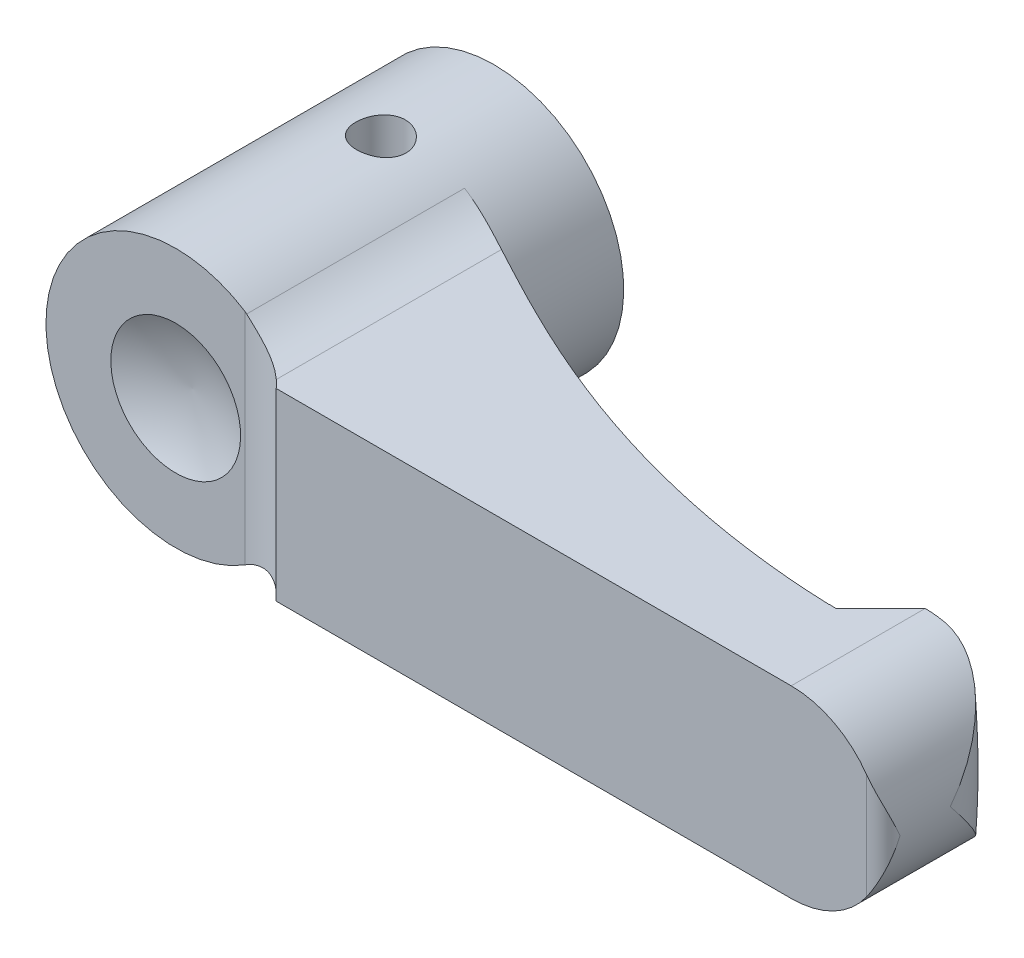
ISO-10303-21;
HEADER;
FILE_DESCRIPTION(('STEP AP214'),'2;1');
FILE_NAME('part.step','',(''),(''),'','','');
FILE_SCHEMA(('AUTOMOTIVE_DESIGN { 1 0 10303 214 1 1 1 1 }'));
ENDSEC;
DATA;
#1=APPLICATION_CONTEXT('core data for automotive mechanical design processes');
#2=APPLICATION_PROTOCOL_DEFINITION('international standard','automotive_design',2000,#1);
#3=PRODUCT_CONTEXT('',#1,'mechanical');
#4=PRODUCT('Part','Part','',(#3));
#5=PRODUCT_RELATED_PRODUCT_CATEGORY('part','',(#4));
#6=PRODUCT_DEFINITION_FORMATION('','',#4);
#7=PRODUCT_DEFINITION_CONTEXT('part definition',#1,'design');
#8=PRODUCT_DEFINITION('design','',#6,#7);
#9=PRODUCT_DEFINITION_SHAPE('','',#8);
#10=(LENGTH_UNIT() NAMED_UNIT(*) SI_UNIT(.MILLI.,.METRE.));
#11=(NAMED_UNIT(*) PLANE_ANGLE_UNIT() SI_UNIT($,.RADIAN.));
#12=(NAMED_UNIT(*) SI_UNIT($,.STERADIAN.) SOLID_ANGLE_UNIT());
#13=UNCERTAINTY_MEASURE_WITH_UNIT(LENGTH_MEASURE(1.E-05),#10,'distance_accuracy_value','');
#14=(GEOMETRIC_REPRESENTATION_CONTEXT(3) GLOBAL_UNCERTAINTY_ASSIGNED_CONTEXT((#13)) GLOBAL_UNIT_ASSIGNED_CONTEXT((#10,
#11,#12)) REPRESENTATION_CONTEXT('',''));
#15=CARTESIAN_POINT('',(0.,0.,0.));
#16=DIRECTION('',(0.,0.,1.));
#17=DIRECTION('',(1.,0.,0.));
#18=AXIS2_PLACEMENT_3D('',#15,#16,#17);
#19=CARTESIAN_POINT('',(38.5,0.,0.));
#20=DIRECTION('',(0.,0.,1.));
#21=DIRECTION('',(0.,-1.,0.));
#22=AXIS2_PLACEMENT_3D('',#19,#20,#21);
#23=CYLINDRICAL_SURFACE('',#22,5.5);
#24=CARTESIAN_POINT('',(44.0000000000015,0.,17.0000000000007));
#25=CARTESIAN_POINT('',(44.0000000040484,-0.00412943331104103,16.9967045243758));
#26=CARTESIAN_POINT('',(43.9999953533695,-0.0082589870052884,16.9934089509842));
#27=CARTESIAN_POINT('',(43.999112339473,-0.400108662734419,16.6806948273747));
#28=CARTESIAN_POINT('',(43.9572034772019,-0.788816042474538,16.37047941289));
#29=CARTESIAN_POINT('',(43.8318985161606,-1.36366951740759,15.9125326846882));
#30=CARTESIAN_POINT('',(43.7795708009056,-1.55425870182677,15.7608439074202));
#31=CARTESIAN_POINT('',(43.6535758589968,-1.93134753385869,15.4612161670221));
#32=CARTESIAN_POINT('',(43.5799185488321,-2.11784903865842,15.3132754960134));
#33=CARTESIAN_POINT('',(43.4309233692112,-2.44124807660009,15.0574517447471));
#34=CARTESIAN_POINT('',(43.3601738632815,-2.579369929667,14.9484282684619));
#35=CARTESIAN_POINT('',(43.2057353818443,-2.85141089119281,14.7343763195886));
#36=CARTESIAN_POINT('',(43.1220435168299,-2.98532905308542,14.6293487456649));
#37=CARTESIAN_POINT('',(42.8513917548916,-3.37883161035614,14.3221362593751));
#38=CARTESIAN_POINT('',(42.6444794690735,-3.63100011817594,14.1271576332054));
#39=CARTESIAN_POINT('',(42.2360437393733,-4.04393333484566,13.814214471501));
#40=CARTESIAN_POINT('',(42.0467235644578,-4.21156281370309,13.6893175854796));
#41=CARTESIAN_POINT('',(41.6377691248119,-4.52442928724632,13.46313419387));
#42=CARTESIAN_POINT('',(41.4181770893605,-4.6696968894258,13.3618153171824));
#43=CARTESIAN_POINT('',(41.0002622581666,-4.90337923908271,13.2094404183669));
#44=CARTESIAN_POINT('',(40.8073147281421,-4.99731688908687,13.1522808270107));
#45=CARTESIAN_POINT('',(40.5069684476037,-5.12190220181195,13.0853303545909));
#46=CARTESIAN_POINT('',(40.4049728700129,-5.1607273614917,13.0661396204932));
#47=CARTESIAN_POINT('',(40.1979126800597,-5.2325019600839,13.0346858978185));
#48=CARTESIAN_POINT('',(40.0928494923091,-5.26545407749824,13.022419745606));
#49=CARTESIAN_POINT('',(39.8792722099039,-5.32541434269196,13.0053554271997));
#50=CARTESIAN_POINT('',(39.7707338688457,-5.35235854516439,13.0006345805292));
#51=CARTESIAN_POINT('',(39.5522177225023,-5.39956667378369,12.999485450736));
#52=CARTESIAN_POINT('',(39.4422407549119,-5.41983432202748,13.0030525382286));
#53=CARTESIAN_POINT('',(39.2221294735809,-5.45352172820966,13.0189098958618));
#54=CARTESIAN_POINT('',(39.1119961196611,-5.46695729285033,13.0311798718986));
#55=CARTESIAN_POINT('',(38.8925476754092,-5.48707811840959,13.0647076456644));
#56=CARTESIAN_POINT('',(38.7832319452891,-5.49376936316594,13.0859574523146));
#57=CARTESIAN_POINT('',(38.64558011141,-5.49815186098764,13.1187159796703));
#58=CARTESIAN_POINT('',(38.6162880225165,-5.49884826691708,13.1260374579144));
#59=CARTESIAN_POINT('',(38.5579005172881,-5.49977248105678,13.1413372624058));
#60=CARTESIAN_POINT('',(38.5288049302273,-5.50000076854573,13.1493149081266));
#61=CARTESIAN_POINT('',(38.4998,-5.49999999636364,13.1576241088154));
#62=B_SPLINE_CURVE_WITH_KNOTS('',3,(#24,#25,#26,#27,#28,#29,#30,#31,#32,#33,#34,#35,#36,#37,#38,
#39,#40,#41,#42,#43,#44,#45,#46,#47,#48,#49,#50,#51,#52,#53,#54,#55,#56,#57,#58,#59,#60,#61),
.UNSPECIFIED.,.F.,.F.,(4,2,2,2,2,2,2,2,2,2,2,2,2,2,2,2,2,2,4),(0.,0.0158501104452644,
1.50396208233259,2.25074088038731,2.99717304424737,3.56562662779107,4.13420730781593,
5.26800636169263,6.11129803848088,6.95342500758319,7.61684533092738,7.94892228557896,
8.28084740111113,8.61615255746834,8.95127046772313,9.28560948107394,9.61965159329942,
9.71024817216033,9.80075194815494),.UNSPECIFIED.);
#63=CARTESIAN_POINT('',(39.6387096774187,-5.38083081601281,13.));
#64=VERTEX_POINT('',#63);
#65=CARTESIAN_POINT('',(44.,0.,17.));
#66=VERTEX_POINT('',#65);
#67=EDGE_CURVE('E388',#64,#66,#62,.F.);
#68=ORIENTED_EDGE('',*,*,#67,.T.);
#69=CARTESIAN_POINT('',(44.0000000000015,0.,17.0000000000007));
#70=CARTESIAN_POINT('',(44.0000000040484,0.00412943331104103,16.9967045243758));
#71=CARTESIAN_POINT('',(43.9999953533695,0.0082589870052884,16.9934089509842));
#72=CARTESIAN_POINT('',(43.999112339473,0.400108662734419,16.6806948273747));
#73=CARTESIAN_POINT('',(43.9572034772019,0.788816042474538,16.37047941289));
#74=CARTESIAN_POINT('',(43.8318985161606,1.36366951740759,15.9125326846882));
#75=CARTESIAN_POINT('',(43.7795708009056,1.55425870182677,15.7608439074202));
#76=CARTESIAN_POINT('',(43.6535758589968,1.93134753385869,15.4612161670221));
#77=CARTESIAN_POINT('',(43.5799185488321,2.11784903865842,15.3132754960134));
#78=CARTESIAN_POINT('',(43.4309233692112,2.44124807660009,15.0574517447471));
#79=CARTESIAN_POINT('',(43.3601738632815,2.579369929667,14.9484282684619));
#80=CARTESIAN_POINT('',(43.2057353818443,2.85141089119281,14.7343763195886));
#81=CARTESIAN_POINT('',(43.1220435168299,2.98532905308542,14.6293487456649));
#82=CARTESIAN_POINT('',(42.8513917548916,3.37883161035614,14.3221362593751));
#83=CARTESIAN_POINT('',(42.6444794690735,3.63100011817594,14.1271576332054));
#84=CARTESIAN_POINT('',(42.2360437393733,4.04393333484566,13.814214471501));
#85=CARTESIAN_POINT('',(42.0467235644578,4.21156281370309,13.6893175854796));
#86=CARTESIAN_POINT('',(41.6377691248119,4.52442928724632,13.46313419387));
#87=CARTESIAN_POINT('',(41.4181770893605,4.6696968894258,13.3618153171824));
#88=CARTESIAN_POINT('',(41.0002622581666,4.90337923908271,13.2094404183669));
#89=CARTESIAN_POINT('',(40.8073147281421,4.99731688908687,13.1522808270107));
#90=CARTESIAN_POINT('',(40.5069684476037,5.12190220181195,13.0853303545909));
#91=CARTESIAN_POINT('',(40.4049728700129,5.1607273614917,13.0661396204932));
#92=CARTESIAN_POINT('',(40.1979126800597,5.2325019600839,13.0346858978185));
#93=CARTESIAN_POINT('',(40.0928494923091,5.26545407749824,13.022419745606));
#94=CARTESIAN_POINT('',(39.8792722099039,5.32541434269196,13.0053554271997));
#95=CARTESIAN_POINT('',(39.7707338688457,5.35235854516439,13.0006345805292));
#96=CARTESIAN_POINT('',(39.5522177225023,5.39956667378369,12.999485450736));
#97=CARTESIAN_POINT('',(39.4422407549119,5.41983432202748,13.0030525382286));
#98=CARTESIAN_POINT('',(39.2221294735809,5.45352172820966,13.0189098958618));
#99=CARTESIAN_POINT('',(39.1119961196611,5.46695729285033,13.0311798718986));
#100=CARTESIAN_POINT('',(38.8925476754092,5.48707811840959,13.0647076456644));
#101=CARTESIAN_POINT('',(38.7832319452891,5.49376936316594,13.0859574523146));
#102=CARTESIAN_POINT('',(38.64558011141,5.49815186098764,13.1187159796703));
#103=CARTESIAN_POINT('',(38.6162880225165,5.49884826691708,13.1260374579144));
#104=CARTESIAN_POINT('',(38.5579005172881,5.49977248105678,13.1413372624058));
#105=CARTESIAN_POINT('',(38.5288049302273,5.50000076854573,13.1493149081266));
#106=CARTESIAN_POINT('',(38.4998,5.49999999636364,13.1576241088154));
#107=B_SPLINE_CURVE_WITH_KNOTS('',3,(#69,#70,#71,#72,#73,#74,#75,#76,#77,#78,#79,#80,#81,#82,
#83,#84,#85,#86,#87,#88,#89,#90,#91,#92,#93,#94,#95,#96,#97,#98,#99,#100,#101,#102,#103,#104,
#105,#106),.UNSPECIFIED.,.F.,.F.,(4,2,2,2,2,2,2,2,2,2,2,2,2,2,2,2,2,2,4),(0.,0.0158501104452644,
1.50396208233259,2.25074088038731,2.99717304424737,3.56562662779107,4.13420730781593,
5.26800636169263,6.11129803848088,6.95342500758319,7.61684533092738,7.94892228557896,
8.28084740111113,8.61615255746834,8.95127046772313,9.28560948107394,9.61965159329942,
9.71024817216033,9.80075194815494),.UNSPECIFIED.);
#108=CARTESIAN_POINT('',(39.6387096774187,5.38083081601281,13.));
#109=VERTEX_POINT('',#108);
#110=EDGE_CURVE('E164',#66,#109,#107,.T.);
#111=ORIENTED_EDGE('',*,*,#110,.T.);
#112=CARTESIAN_POINT('',(38.5,0.,13.));
#113=DIRECTION('',(0.,0.,-1.));
#114=DIRECTION('',(0.,1.,0.));
#115=AXIS2_PLACEMENT_3D('',#112,#113,#114);
#116=CIRCLE('',#115,5.5);
#117=CARTESIAN_POINT('',(38.5,5.5,13.));
#118=VERTEX_POINT('',#117);
#119=EDGE_CURVE('E368',#109,#118,#116,.F.);
#120=ORIENTED_EDGE('',*,*,#119,.T.);
#121=DIRECTION('',(0.,0.,1.));
#122=VECTOR('',#121,1.);
#123=CARTESIAN_POINT('',(38.5,5.5,0.));
#124=LINE('',#123,#122);
#125=CARTESIAN_POINT('',(38.5,5.5,21.));
#126=VERTEX_POINT('',#125);
#127=EDGE_CURVE('E335',#118,#126,#124,.T.);
#128=ORIENTED_EDGE('',*,*,#127,.T.);
#129=CARTESIAN_POINT('',(38.5,0.,21.));
#130=DIRECTION('',(0.,0.,1.));
#131=DIRECTION('',(0.,-1.,0.));
#132=AXIS2_PLACEMENT_3D('',#129,#130,#131);
#133=CIRCLE('',#132,5.5);
#134=CARTESIAN_POINT('',(43.,3.16227766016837,21.));
#135=VERTEX_POINT('',#134);
#136=EDGE_CURVE('E355',#135,#126,#133,.T.);
#137=ORIENTED_EDGE('',*,*,#136,.F.);
#138=CARTESIAN_POINT('',(43.,3.16227766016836,21.));
#139=CARTESIAN_POINT('',(43.0489698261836,3.09261080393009,20.9999556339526));
#140=CARTESIAN_POINT('',(43.0962528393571,3.02186876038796,20.9964077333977));
#141=CARTESIAN_POINT('',(43.187187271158,2.87878712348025,20.9834058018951));
#142=CARTESIAN_POINT('',(43.2308453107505,2.80645076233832,20.9739628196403));
#143=CARTESIAN_POINT('',(43.3141980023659,2.66092047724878,20.9503365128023));
#144=CARTESIAN_POINT('',(43.353915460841,2.58773460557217,20.9361828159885));
#145=CARTESIAN_POINT('',(43.4296865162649,2.44030003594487,20.9039171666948));
#146=CARTESIAN_POINT('',(43.4657377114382,2.3660506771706,20.8858026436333));
#147=CARTESIAN_POINT('',(43.5573559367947,2.16613298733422,20.8329178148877));
#148=CARTESIAN_POINT('',(43.6095944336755,2.0397138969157,20.7951786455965));
#149=CARTESIAN_POINT('',(43.7039555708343,1.78529411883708,20.7129945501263));
#150=CARTESIAN_POINT('',(43.7460735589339,1.65729273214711,20.668546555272));
#151=CARTESIAN_POINT('',(43.8205857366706,1.39978291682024,20.5746664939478));
#152=CARTESIAN_POINT('',(43.8529463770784,1.27027084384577,20.5252179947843));
#153=CARTESIAN_POINT('',(43.9079882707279,1.01058108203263,20.4229956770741));
#154=CARTESIAN_POINT('',(43.930673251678,0.880403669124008,20.3702231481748));
#155=CARTESIAN_POINT('',(43.9654953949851,0.627432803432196,20.2658240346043));
#156=CARTESIAN_POINT('',(43.978182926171,0.504664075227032,20.2143181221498));
#157=CARTESIAN_POINT('',(43.9952673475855,0.259135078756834,20.1104803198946));
#158=CARTESIAN_POINT('',(43.9996786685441,0.136375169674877,20.0581500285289));
#159=CARTESIAN_POINT('',(43.9999943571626,0.00909584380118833,20.0038784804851));
#160=CARTESIAN_POINT('',(43.9999999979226,0.00454789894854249,20.0019392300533));
#161=CARTESIAN_POINT('',(44.,0.,20.0000000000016));
#162=B_SPLINE_CURVE_WITH_KNOTS('',3,(#138,#139,#140,#141,#142,#143,#144,#145,#146,#147,#148,
#149,#150,#151,#152,#153,#154,#155,#156,#157,#158,#159,#160,#161),.UNSPECIFIED.,.F.,.F.,(4,2,2,
2,2,2,2,2,2,2,2,4),(0.,0.255244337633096,0.510011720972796,0.763206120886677,1.01656533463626,
1.44159949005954,1.86682865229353,2.29350365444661,2.72001412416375,3.12097942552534,
3.52124493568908,3.53607734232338),.UNSPECIFIED.);
#163=CARTESIAN_POINT('',(44.,0.,20.0000000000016));
#164=VERTEX_POINT('',#163);
#165=EDGE_CURVE('E174',#164,#135,#162,.F.);
#166=ORIENTED_EDGE('',*,*,#165,.F.);
#167=CARTESIAN_POINT('',(43.,-3.16227766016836,21.));
#168=CARTESIAN_POINT('',(43.0489698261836,-3.09261080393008,20.9999556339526));
#169=CARTESIAN_POINT('',(43.0962528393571,-3.02186876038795,20.9964077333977));
#170=CARTESIAN_POINT('',(43.1871872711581,-2.87878712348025,20.9834058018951));
#171=CARTESIAN_POINT('',(43.2308453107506,-2.80645076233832,20.9739628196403));
#172=CARTESIAN_POINT('',(43.3141980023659,-2.66092047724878,20.9503365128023));
#173=CARTESIAN_POINT('',(43.353915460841,-2.58773460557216,20.9361828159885));
#174=CARTESIAN_POINT('',(43.4296865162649,-2.44030003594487,20.9039171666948));
#175=CARTESIAN_POINT('',(43.4657377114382,-2.3660506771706,20.8858026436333));
#176=CARTESIAN_POINT('',(43.5573559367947,-2.16613298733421,20.8329178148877));
#177=CARTESIAN_POINT('',(43.6095944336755,-2.03971389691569,20.7951786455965));
#178=CARTESIAN_POINT('',(43.7039555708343,-1.78529411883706,20.7129945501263));
#179=CARTESIAN_POINT('',(43.7460735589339,-1.6572927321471,20.668546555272));
#180=CARTESIAN_POINT('',(43.8205857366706,-1.39978291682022,20.5746664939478));
#181=CARTESIAN_POINT('',(43.8529463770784,-1.27027084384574,20.5252179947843));
#182=CARTESIAN_POINT('',(43.9079882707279,-1.0105810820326,20.4229956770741));
#183=CARTESIAN_POINT('',(43.930673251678,-0.880403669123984,20.3702231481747));
#184=CARTESIAN_POINT('',(43.9654953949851,-0.627432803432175,20.2658240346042));
#185=CARTESIAN_POINT('',(43.978182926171,-0.504664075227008,20.2143181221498));
#186=CARTESIAN_POINT('',(43.9952673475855,-0.259135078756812,20.1104803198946));
#187=CARTESIAN_POINT('',(43.9996786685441,-0.136375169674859,20.0581500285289));
#188=CARTESIAN_POINT('',(43.9999943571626,-0.00909584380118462,20.0038784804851));
#189=CARTESIAN_POINT('',(43.9999999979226,-0.00454789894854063,20.0019392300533));
#190=CARTESIAN_POINT('',(44.,0.,20.0000000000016));
#191=B_SPLINE_CURVE_WITH_KNOTS('',3,(#167,#168,#169,#170,#171,#172,#173,#174,#175,#176,#177,
#178,#179,#180,#181,#182,#183,#184,#185,#186,#187,#188,#189,#190),.UNSPECIFIED.,.F.,.F.,(4,2,2,
2,2,2,2,2,2,2,2,4),(0.,0.2552443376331,0.510011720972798,0.76320612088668,1.01656533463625,
1.44159949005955,1.86682865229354,2.29350365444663,2.72001412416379,3.12097942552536,
3.52124493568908,3.53607734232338),.UNSPECIFIED.);
#192=CARTESIAN_POINT('',(43.,-3.16227766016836,21.));
#193=VERTEX_POINT('',#192);
#194=EDGE_CURVE('E9',#193,#164,#191,.T.);
#195=ORIENTED_EDGE('',*,*,#194,.F.);
#196=CARTESIAN_POINT('',(38.5,-5.5,21.));
#197=VERTEX_POINT('',#196);
#198=EDGE_CURVE('E356',#197,#193,#133,.T.);
#199=ORIENTED_EDGE('',*,*,#198,.F.);
#200=DIRECTION('',(0.,0.,1.));
#201=VECTOR('',#200,1.);
#202=CARTESIAN_POINT('',(38.5,-5.5,0.));
#203=LINE('',#202,#201);
#204=CARTESIAN_POINT('',(38.5,-5.5,13.));
#205=VERTEX_POINT('',#204);
#206=EDGE_CURVE('E341',#205,#197,#203,.T.);
#207=ORIENTED_EDGE('',*,*,#206,.F.);
#208=EDGE_CURVE('E28',#205,#64,#116,.F.);
#209=ORIENTED_EDGE('',*,*,#208,.T.);
#210=EDGE_LOOP('',(#68,#111,#120,#128,#137,#166,#195,#199,#207,#209));
#211=FACE_BOUND('',#210,.T.);
#212=ADVANCED_FACE('F14',(#211),#23,.T.);
#213=CARTESIAN_POINT('',(38.0113693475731,-11.,-36.28769945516));
#214=DIRECTION('',(0.,1.,0.));
#215=DIRECTION('',(-1.,0.,0.));
#216=AXIS2_PLACEMENT_3D('',#213,#214,#215);
#217=CYLINDRICAL_SURFACE('',#216,52.0000000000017);
#218=CARTESIAN_POINT('',(35.2526287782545,6.6002,15.6390696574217));
#219=CARTESIAN_POINT('',(35.3306710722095,6.15778148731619,15.6432089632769));
#220=CARTESIAN_POINT('',(35.4010151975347,5.71399671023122,15.6467763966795));
#221=CARTESIAN_POINT('',(35.5260850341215,4.8242127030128,15.6529153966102));
#222=CARTESIAN_POINT('',(35.5808102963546,4.37821340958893,15.6554869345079));
#223=CARTESIAN_POINT('',(35.6744349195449,3.48436157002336,15.6597826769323));
#224=CARTESIAN_POINT('',(35.7133278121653,3.03650834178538,15.661506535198));
#225=CARTESIAN_POINT('',(35.7751087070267,2.13972320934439,15.6642018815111));
#226=CARTESIAN_POINT('',(35.7979969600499,1.69079132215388,15.6651733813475));
#227=CARTESIAN_POINT('',(35.8421331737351,0.354195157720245,15.6670470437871));
#228=CARTESIAN_POINT('',(35.8400114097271,-0.534351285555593,15.6669575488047));
#229=CARTESIAN_POINT('',(35.7729034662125,-2.3086296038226,15.6641084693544));
#230=CARTESIAN_POINT('',(35.7079471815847,-3.19436261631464,15.6613501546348));
#231=CARTESIAN_POINT('',(35.566302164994,-4.49842899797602,15.6548034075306));
#232=CARTESIAN_POINT('',(35.5134242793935,-4.91947185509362,15.6523036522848));
#233=CARTESIAN_POINT('',(35.3935695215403,-5.76081148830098,15.6463998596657));
#234=CARTESIAN_POINT('',(35.3265514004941,-6.18110237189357,15.6429931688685));
#235=CARTESIAN_POINT('',(35.2526287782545,-6.6002,15.6390696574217));
#236=B_SPLINE_CURVE_WITH_KNOTS('',3,(#218,#219,#220,#221,#222,#223,#224,#225,#226,#227,#228,
#229,#230,#231,#232,#233,#234,#235),.UNSPECIFIED.,.F.,.F.,(4,2,2,2,2,2,2,2,4),(0.,
1.34773929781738,2.69551733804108,4.0438454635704,5.3921524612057,8.05541696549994,
10.7174149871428,11.9902864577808,13.2669236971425),.UNSPECIFIED.);
#237=CARTESIAN_POINT('',(35.4303781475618,5.5,15.6482080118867));
#238=VERTEX_POINT('',#237);
#239=CARTESIAN_POINT('',(35.833333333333,0.,15.666666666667));
#240=VERTEX_POINT('',#239);
#241=EDGE_CURVE('E293',#238,#240,#236,.T.);
#242=ORIENTED_EDGE('',*,*,#241,.F.);
#243=CARTESIAN_POINT('',(38.0113693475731,5.5,-36.28769945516));
#244=DIRECTION('',(0.,-1.,0.));
#245=DIRECTION('',(1.,0.,0.));
#246=AXIS2_PLACEMENT_3D('',#243,#244,#245);
#247=CIRCLE('',#246,52.0000000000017);
#248=CARTESIAN_POINT('',(35.833333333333,5.5,15.666666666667));
#249=VERTEX_POINT('',#248);
#250=EDGE_CURVE('E331',#238,#249,#247,.F.);
#251=ORIENTED_EDGE('',*,*,#250,.T.);
#252=DIRECTION('',(0.,1.,0.));
#253=VECTOR('',#252,1.);
#254=CARTESIAN_POINT('',(35.833333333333,-11.,15.666666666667));
#255=LINE('',#254,#253);
#256=EDGE_CURVE('E254',#240,#249,#255,.T.);
#257=ORIENTED_EDGE('',*,*,#256,.F.);
#258=EDGE_LOOP('',(#242,#251,#257));
#259=FACE_BOUND('',#258,.T.);
#260=ADVANCED_FACE('F141',(#259),#217,.F.);
#261=CARTESIAN_POINT('',(40.,-11.,13.));
#262=DIRECTION('',(0.,0.,-1.));
#263=DIRECTION('',(0.,1.,0.));
#264=AXIS2_PLACEMENT_3D('',#261,#262,#263);
#265=PLANE('',#264);
#266=ORIENTED_EDGE('',*,*,#119,.F.);
#267=CARTESIAN_POINT('',(-0.25,0.,13.));
#268=DIRECTION('',(0.,0.,-1.));
#269=DIRECTION('',(0.,1.,0.));
#270=AXIS2_PLACEMENT_3D('',#267,#268,#269);
#271=CIRCLE('',#270,40.2499999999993);
#272=EDGE_CURVE('E43',#109,#64,#271,.T.);
#273=ORIENTED_EDGE('',*,*,#272,.T.);
#274=ORIENTED_EDGE('',*,*,#208,.F.);
#275=DIRECTION('',(0.,1.,0.));
#276=VECTOR('',#275,1.);
#277=CARTESIAN_POINT('',(38.5,-11.,13.));
#278=LINE('',#277,#276);
#279=EDGE_CURVE('E326',#205,#118,#278,.T.);
#280=ORIENTED_EDGE('',*,*,#279,.T.);
#281=EDGE_LOOP('',(#266,#273,#274,#280));
#282=FACE_BOUND('',#281,.T.);
#283=ADVANCED_FACE('F147',(#282),#265,.T.);
#284=CARTESIAN_POINT('',(7.5,0.,0.));
#285=DIRECTION('',(0.,0.,1.));
#286=DIRECTION('',(0.,-1.,0.));
#287=AXIS2_PLACEMENT_3D('',#284,#285,#286);
#288=PLANE('',#287);
#289=CARTESIAN_POINT('',(0.,0.,0.));
#290=DIRECTION('',(0.,0.,-1.));
#291=DIRECTION('',(0.,1.,0.));
#292=AXIS2_PLACEMENT_3D('',#289,#290,#291);
#293=CIRCLE('',#292,3.);
#294=CARTESIAN_POINT('',(0.,3.,0.));
#295=VERTEX_POINT('',#294);
#296=EDGE_CURVE('E577',#295,#295,#293,.T.);
#297=ORIENTED_EDGE('',*,*,#296,.F.);
#298=EDGE_LOOP('',(#297));
#299=FACE_BOUND('',#298,.T.);
#300=CARTESIAN_POINT('',(-0.25,0.,0.));
#301=DIRECTION('',(0.,0.,-1.));
#302=DIRECTION('',(0.,1.,0.));
#303=AXIS2_PLACEMENT_3D('',#300,#301,#302);
#304=CIRCLE('',#303,7.75);
#305=CARTESIAN_POINT('',(-0.25,7.75,0.));
#306=VERTEX_POINT('',#305);
#307=EDGE_CURVE('E350',#306,#306,#304,.T.);
#308=ORIENTED_EDGE('',*,*,#307,.T.);
#309=EDGE_LOOP('',(#308));
#310=FACE_BOUND('',#309,.T.);
#311=ADVANCED_FACE('F449',(#299,#310),#288,.F.);
#312=CARTESIAN_POINT('',(0.,0.,21.));
#313=DIRECTION('',(0.,0.,1.));
#314=DIRECTION('',(0.,-1.,0.));
#315=AXIS2_PLACEMENT_3D('',#312,#313,#314);
#316=PLANE('',#315);
#317=DIRECTION('',(1.,0.,0.));
#318=VECTOR('',#317,1.);
#319=CARTESIAN_POINT('',(7.2874067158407,5.5,21.));
#320=LINE('',#319,#318);
#321=CARTESIAN_POINT('',(7.75,5.5,21.));
#322=VERTEX_POINT('',#321);
#323=EDGE_CURVE('E330',#322,#126,#320,.T.);
#324=ORIENTED_EDGE('',*,*,#323,.F.);
#325=DIRECTION('',(0.,1.,0.));
#326=VECTOR('',#325,1.);
#327=CARTESIAN_POINT('',(7.75,-11.,21.));
#328=LINE('',#327,#326);
#329=CARTESIAN_POINT('',(7.75,-5.5,21.));
#330=VERTEX_POINT('',#329);
#331=EDGE_CURVE('E394',#330,#322,#328,.T.);
#332=ORIENTED_EDGE('',*,*,#331,.F.);
#333=DIRECTION('',(-1.,0.,0.));
#334=VECTOR('',#333,1.);
#335=CARTESIAN_POINT('',(38.5,-5.5,21.));
#336=LINE('',#335,#334);
#337=EDGE_CURVE('E416',#197,#330,#336,.T.);
#338=ORIENTED_EDGE('',*,*,#337,.F.);
#339=ORIENTED_EDGE('',*,*,#198,.T.);
#340=DIRECTION('',(0.,1.,0.));
#341=VECTOR('',#340,1.);
#342=CARTESIAN_POINT('',(43.,-11.,21.));
#343=LINE('',#342,#341);
#344=EDGE_CURVE('E365',#193,#135,#343,.T.);
#345=ORIENTED_EDGE('',*,*,#344,.T.);
#346=ORIENTED_EDGE('',*,*,#136,.T.);
#347=EDGE_LOOP('',(#324,#332,#338,#339,#345,#346));
#348=FACE_BOUND('',#347,.T.);
#349=ADVANCED_FACE('F241',(#348),#316,.T.);
#350=CARTESIAN_POINT('',(-0.25,0.,0.));
#351=DIRECTION('',(0.,0.,-1.));
#352=DIRECTION('',(0.,1.,0.));
#353=AXIS2_PLACEMENT_3D('',#350,#351,#352);
#354=CYLINDRICAL_SURFACE('',#353,7.75);
#355=CARTESIAN_POINT('',(-0.25,7.75,8.4790199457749));
#356=CARTESIAN_POINT('',(-0.332498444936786,7.74999864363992,8.46507196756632));
#357=CARTESIAN_POINT('',(-0.413867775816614,7.74866968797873,8.44419744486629));
#358=CARTESIAN_POINT('',(-0.571972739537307,7.74371421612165,8.38919601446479));
#359=CARTESIAN_POINT('',(-0.64870423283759,7.7400856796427,8.3550574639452));
#360=CARTESIAN_POINT('',(-0.795269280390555,7.73114290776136,8.27456998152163));
#361=CARTESIAN_POINT('',(-0.865109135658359,7.72583023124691,8.22823234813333));
#362=CARTESIAN_POINT('',(-0.99606012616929,7.71428693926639,8.12464864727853));
#363=CARTESIAN_POINT('',(-1.05717214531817,7.70805641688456,8.06740368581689));
#364=CARTESIAN_POINT('',(-1.16959793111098,7.6954582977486,7.94294347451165));
#365=CARTESIAN_POINT('',(-1.22080779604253,7.68908995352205,7.87563440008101));
#366=CARTESIAN_POINT('',(-1.31123624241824,7.67713264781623,7.73332581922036));
#367=CARTESIAN_POINT('',(-1.35045457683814,7.67154370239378,7.6583261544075));
#368=CARTESIAN_POINT('',(-1.41581585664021,7.66188443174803,7.50259929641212));
#369=CARTESIAN_POINT('',(-1.44193898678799,7.65781641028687,7.42186363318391));
#370=CARTESIAN_POINT('',(-1.4802252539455,7.65175969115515,7.25707388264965));
#371=CARTESIAN_POINT('',(-1.49238957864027,7.64977081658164,7.17302007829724));
#372=CARTESIAN_POINT('',(-1.50232229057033,7.64815102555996,7.00502986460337));
#373=CARTESIAN_POINT('',(-1.50025687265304,7.64849288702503,6.92110351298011));
#374=CARTESIAN_POINT('',(-1.48218619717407,7.65142464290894,6.75480801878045));
#375=CARTESIAN_POINT('',(-1.46618118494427,7.65401449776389,6.67243884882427));
#376=CARTESIAN_POINT('',(-1.42080117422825,7.66108639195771,6.51188171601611));
#377=CARTESIAN_POINT('',(-1.39147435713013,7.6655616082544,6.43367981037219));
#378=CARTESIAN_POINT('',(-1.3203164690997,7.67581972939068,6.28328062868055));
#379=CARTESIAN_POINT('',(-1.27848444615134,7.68160273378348,6.21108381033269));
#380=CARTESIAN_POINT('',(-1.18296117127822,7.69379095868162,6.07389832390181));
#381=CARTESIAN_POINT('',(-1.12914631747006,7.70020224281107,6.00899624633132));
#382=CARTESIAN_POINT('',(-1.01140258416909,7.71273385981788,5.88908786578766));
#383=CARTESIAN_POINT('',(-0.947473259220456,7.71885417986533,5.83408199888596));
#384=CARTESIAN_POINT('',(-0.810825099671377,7.72998672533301,5.73520059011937));
#385=CARTESIAN_POINT('',(-0.738055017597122,7.73499196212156,5.69139500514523));
#386=CARTESIAN_POINT('',(-0.586086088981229,7.74308257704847,5.61664468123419));
#387=CARTESIAN_POINT('',(-0.506887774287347,7.7461681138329,5.5856988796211));
#388=CARTESIAN_POINT('',(-0.345228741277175,7.74983184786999,5.53786264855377));
#389=CARTESIAN_POINT('',(-0.262812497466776,7.75043676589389,5.52082402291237));
#390=CARTESIAN_POINT('',(-0.0963201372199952,7.74892310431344,5.50074958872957));
#391=CARTESIAN_POINT('',(-0.0122441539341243,7.74680474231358,5.49771266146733));
#392=CARTESIAN_POINT('',(0.154171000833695,7.73989699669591,5.50564627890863));
#393=CARTESIAN_POINT('',(0.236519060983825,7.73513809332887,5.51645878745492));
#394=CARTESIAN_POINT('',(0.398148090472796,7.72327484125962,5.55144339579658));
#395=CARTESIAN_POINT('',(0.477428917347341,7.71617038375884,5.5756161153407));
#396=CARTESIAN_POINT('',(0.631384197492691,7.70011064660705,5.6368161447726));
#397=CARTESIAN_POINT('',(0.706017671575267,7.69114129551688,5.67394273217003));
#398=CARTESIAN_POINT('',(0.848032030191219,7.67215522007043,5.75994551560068));
#399=CARTESIAN_POINT('',(0.915411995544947,7.66213836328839,5.80882319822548));
#400=CARTESIAN_POINT('',(1.04235039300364,7.64176328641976,5.91803606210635));
#401=CARTESIAN_POINT('',(1.10173833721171,7.63140218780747,5.97856902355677));
#402=CARTESIAN_POINT('',(1.20954466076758,7.61152036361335,6.10884871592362));
#403=CARTESIAN_POINT('',(1.25796267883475,7.60199966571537,6.17859575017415));
#404=CARTESIAN_POINT('',(1.34254120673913,7.58473387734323,6.32561697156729));
#405=CARTESIAN_POINT('',(1.37866981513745,7.57699342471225,6.40291008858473));
#406=CARTESIAN_POINT('',(1.43735909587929,7.56414102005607,6.56269096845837));
#407=CARTESIAN_POINT('',(1.4599219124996,7.55902865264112,6.64517790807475));
#408=CARTESIAN_POINT('',(1.49040887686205,7.55206718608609,6.81117575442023));
#409=CARTESIAN_POINT('',(1.49862689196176,7.55015261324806,6.89462995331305));
#410=CARTESIAN_POINT('',(1.50105594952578,7.54958976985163,7.06174836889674));
#411=CARTESIAN_POINT('',(1.49526838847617,7.550941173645,7.14541256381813));
#412=CARTESIAN_POINT('',(1.47008664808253,7.556716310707,7.30919844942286));
#413=CARTESIAN_POINT('',(1.45090786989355,7.56109139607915,7.38935515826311));
#414=CARTESIAN_POINT('',(1.39978217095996,7.57241038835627,7.54529252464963));
#415=CARTESIAN_POINT('',(1.36783435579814,7.57935447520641,7.62107287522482));
#416=CARTESIAN_POINT('',(1.2916651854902,7.59521512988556,7.76711412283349));
#417=CARTESIAN_POINT('',(1.24730310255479,7.60415406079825,7.83729911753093));
#418=CARTESIAN_POINT('',(1.14771527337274,7.62308694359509,7.96932396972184));
#419=CARTESIAN_POINT('',(1.09248827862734,7.63308101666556,8.031162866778));
#420=CARTESIAN_POINT('',(0.971280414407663,7.65341928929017,8.14618923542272));
#421=CARTESIAN_POINT('',(0.905086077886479,7.66376631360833,8.19915148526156));
#422=CARTESIAN_POINT('',(0.764629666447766,7.68362218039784,8.2932468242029));
#423=CARTESIAN_POINT('',(0.690366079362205,7.69313086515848,8.3343776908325));
#424=CARTESIAN_POINT('',(0.53555789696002,7.71047866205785,8.40370749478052));
#425=CARTESIAN_POINT('',(0.454994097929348,7.71831237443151,8.43186493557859));
#426=CARTESIAN_POINT('',(0.290124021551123,7.73159639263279,8.47412869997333));
#427=CARTESIAN_POINT('',(0.20582144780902,7.73704900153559,8.4882486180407));
#428=CARTESIAN_POINT('',(0.0591083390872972,7.74408156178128,8.5001194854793));
#429=CARTESIAN_POINT('',(-0.00301664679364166,7.74631158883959,8.50127928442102));
#430=CARTESIAN_POINT('',(-0.126968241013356,7.74927129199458,8.49590338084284));
#431=CARTESIAN_POINT('',(-0.188794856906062,7.75000100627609,8.48936787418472));
#432=CARTESIAN_POINT('',(-0.25,7.75,8.4790199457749));
#433=B_SPLINE_CURVE_WITH_KNOTS('',3,(#355,#356,#357,#358,#359,#360,#361,#362,#363,#364,#365,
#366,#367,#368,#369,#370,#371,#372,#373,#374,#375,#376,#377,#378,#379,#380,#381,#382,#383,#384,
#385,#386,#387,#388,#389,#390,#391,#392,#393,#394,#395,#396,#397,#398,#399,#400,#401,#402,#403,
#404,#405,#406,#407,#408,#409,#410,#411,#412,#413,#414,#415,#416,#417,#418,#419,#420,#421,#422,
#423,#424,#425,#426,#427,#428,#429,#430,#431,#432),.UNSPECIFIED.,.T.,.F.,(4,2,2,2,2,2,2,2,2,2,2,
2,2,2,2,2,2,2,2,2,2,2,2,2,2,2,2,2,2,2,2,2,2,2,2,2,2,2,4),(0.,0.250779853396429,
0.501780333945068,0.752549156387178,1.00329256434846,1.25653903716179,1.50979072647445,
1.7634244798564,2.01703665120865,2.26769184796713,2.51834263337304,2.76809401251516,
3.01786440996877,3.27034148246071,3.52282967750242,3.77685837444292,4.03086607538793,
4.28213034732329,4.53337454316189,4.78177716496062,5.03019131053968,5.28055269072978,
5.53094575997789,5.78603722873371,6.04113709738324,6.29689420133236,6.55261086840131,
6.80302459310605,7.05341335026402,7.29986463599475,7.54633318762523,7.79571752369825,
8.04513053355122,8.30013916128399,8.55519566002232,8.81106240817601,9.06668112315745,
9.2527380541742,9.43879024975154),.UNSPECIFIED.);
#434=CARTESIAN_POINT('',(-0.25,7.75,8.4790199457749));
#435=VERTEX_POINT('',#434);
#436=EDGE_CURVE('E584',#435,#435,#433,.T.);
#437=ORIENTED_EDGE('',*,*,#436,.T.);
#438=EDGE_LOOP('',(#437));
#439=FACE_BOUND('',#438,.T.);
#440=CARTESIAN_POINT('',(-0.25,0.,6.));
#441=DIRECTION('',(0.,0.,-1.));
#442=DIRECTION('',(0.,1.,0.));
#443=AXIS2_PLACEMENT_3D('',#440,#441,#442);
#444=CIRCLE('',#443,7.75);
#445=CARTESIAN_POINT('',(3.99835651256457,6.48181818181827,6.));
#446=VERTEX_POINT('',#445);
#447=CARTESIAN_POINT('',(3.99835651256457,-6.48181818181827,6.));
#448=VERTEX_POINT('',#447);
#449=EDGE_CURVE('E381',#446,#448,#444,.T.);
#450=ORIENTED_EDGE('',*,*,#449,.T.);
#451=DIRECTION('',(0.,0.,1.));
#452=VECTOR('',#451,1.);
#453=CARTESIAN_POINT('',(3.9983565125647,-6.4818181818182,0.));
#454=LINE('',#453,#452);
#455=CARTESIAN_POINT('',(3.9983565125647,-6.4818181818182,19.0142376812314));
#456=VERTEX_POINT('',#455);
#457=EDGE_CURVE('E419',#448,#456,#454,.T.);
#458=ORIENTED_EDGE('',*,*,#457,.T.);
#459=CARTESIAN_POINT('',(3.875,-6.56101173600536,19.));
#460=CARTESIAN_POINT('',(3.89570053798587,-6.54799679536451,19.0021736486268));
#461=CARTESIAN_POINT('',(3.91633051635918,-6.53488986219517,19.0044469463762));
#462=CARTESIAN_POINT('',(3.95744935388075,-6.50849201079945,19.00919284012));
#463=CARTESIAN_POINT('',(3.977938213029,-6.49520109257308,19.0116654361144));
#464=CARTESIAN_POINT('',(3.99835651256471,-6.48181818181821,19.0142376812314));
#465=B_SPLINE_CURVE_WITH_KNOTS('',3,(#459,#460,#461,#462,#463,#464),.UNSPECIFIED.,.F.,.F.,(4,2,
4),(0.,0.0736410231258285,0.147282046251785),.UNSPECIFIED.);
#466=CARTESIAN_POINT('',(3.875,-6.56101173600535,19.));
#467=VERTEX_POINT('',#466);
#468=EDGE_CURVE('E214',#467,#456,#465,.T.);
#469=ORIENTED_EDGE('',*,*,#468,.F.);
#470=CARTESIAN_POINT('',(-0.25,0.,19.));
#471=DIRECTION('',(0.,0.,-1.));
#472=DIRECTION('',(0.,1.,0.));
#473=AXIS2_PLACEMENT_3D('',#470,#471,#472);
#474=CIRCLE('',#473,7.75);
#475=CARTESIAN_POINT('',(3.875,6.56101173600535,19.));
#476=VERTEX_POINT('',#475);
#477=EDGE_CURVE('E353',#467,#476,#474,.T.);
#478=ORIENTED_EDGE('',*,*,#477,.T.);
#479=CARTESIAN_POINT('',(3.99835651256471,6.48181818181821,19.0142376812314));
#480=CARTESIAN_POINT('',(3.977938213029,6.49520109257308,19.0116654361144));
#481=CARTESIAN_POINT('',(3.95744935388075,6.50849201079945,19.00919284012));
#482=CARTESIAN_POINT('',(3.91633051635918,6.53488986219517,19.0044469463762));
#483=CARTESIAN_POINT('',(3.89570053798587,6.54799679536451,19.0021736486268));
#484=CARTESIAN_POINT('',(3.875,6.56101173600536,19.));
#485=B_SPLINE_CURVE_WITH_KNOTS('',3,(#479,#480,#481,#482,#483,#484),.UNSPECIFIED.,.F.,.F.,(4,2,
4),(0.,0.0736410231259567,0.147282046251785),.UNSPECIFIED.);
#486=CARTESIAN_POINT('',(3.9983565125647,6.4818181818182,19.0142376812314));
#487=VERTEX_POINT('',#486);
#488=EDGE_CURVE('E228',#487,#476,#485,.T.);
#489=ORIENTED_EDGE('',*,*,#488,.F.);
#490=DIRECTION('',(0.,0.,1.));
#491=VECTOR('',#490,1.);
#492=CARTESIAN_POINT('',(3.9983565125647,6.4818181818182,0.));
#493=LINE('',#492,#491);
#494=EDGE_CURVE('E343',#446,#487,#493,.T.);
#495=ORIENTED_EDGE('',*,*,#494,.F.);
#496=EDGE_LOOP('',(#450,#458,#469,#478,#489,#495));
#497=FACE_BOUND('',#496,.T.);
#498=ORIENTED_EDGE('',*,*,#307,.F.);
#499=EDGE_LOOP('',(#498));
#500=FACE_BOUND('',#499,.T.);
#501=ADVANCED_FACE('F239',(#439,#497,#500),#354,.T.);
#502=CARTESIAN_POINT('',(7.28740671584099,11.5000000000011,0.));
#503=DIRECTION('',(0.,0.,1.));
#504=DIRECTION('',(0.,-1.,0.));
#505=AXIS2_PLACEMENT_3D('',#502,#503,#504);
#506=CYLINDRICAL_SURFACE('',#505,6.00000000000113);
#507=DIRECTION('',(0.,0.,1.));
#508=VECTOR('',#507,1.);
#509=CARTESIAN_POINT('',(7.28740671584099,5.5,0.));
#510=LINE('',#509,#508);
#511=CARTESIAN_POINT('',(7.28740671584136,5.5,7.08685738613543));
#512=VERTEX_POINT('',#511);
#513=CARTESIAN_POINT('',(7.28740671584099,5.5,20.5299560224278));
#514=VERTEX_POINT('',#513);
#515=EDGE_CURVE('E340',#512,#514,#510,.T.);
#516=ORIENTED_EDGE('',*,*,#515,.F.);
#517=CARTESIAN_POINT('',(7.28760671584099,5.50000000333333,7.08696413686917));
#518=CARTESIAN_POINT('',(7.15034044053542,5.50001326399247,7.01373970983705));
#519=CARTESIAN_POINT('',(7.01226219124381,5.50470337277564,6.94191829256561));
#520=CARTESIAN_POINT('',(6.73442352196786,5.52390552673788,6.80226274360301));
#521=CARTESIAN_POINT('',(6.59466016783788,5.53843827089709,6.73443734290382));
#522=CARTESIAN_POINT('',(6.31196481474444,5.57807947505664,6.60334347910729));
#523=CARTESIAN_POINT('',(6.1690160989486,5.60333637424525,6.54015416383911));
#524=CARTESIAN_POINT('',(5.88256013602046,5.66494278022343,6.42128538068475));
#525=CARTESIAN_POINT('',(5.73905348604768,5.70128257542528,6.36559939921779));
#526=CARTESIAN_POINT('',(5.3843070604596,5.80557517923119,6.23976759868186));
#527=CARTESIAN_POINT('',(5.17294146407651,5.88035833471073,6.1751312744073));
#528=CARTESIAN_POINT('',(4.85989295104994,6.01183658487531,6.09931612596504));
#529=CARTESIAN_POINT('',(4.75651283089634,6.05871150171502,6.07760127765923));
#530=CARTESIAN_POINT('',(4.55154846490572,6.15883414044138,6.04183297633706));
#531=CARTESIAN_POINT('',(4.44996313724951,6.21207786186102,6.02777474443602));
#532=CARTESIAN_POINT('',(4.29011865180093,6.30183274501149,6.01191660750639));
#533=CARTESIAN_POINT('',(4.23099705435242,6.33637230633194,6.00745749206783));
#534=CARTESIAN_POINT('',(4.11375451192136,6.4075890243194,6.00149177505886));
#535=CARTESIAN_POINT('',(4.05563561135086,6.4442700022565,5.99999062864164));
#536=CARTESIAN_POINT('',(3.99815651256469,6.48194927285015,6.00000000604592));
#537=B_SPLINE_CURVE_WITH_KNOTS('',3,(#517,#518,#519,#520,#521,#522,#523,#524,#525,#526,#527,
#528,#529,#530,#531,#532,#533,#534,#535,#536),.UNSPECIFIED.,.F.,.F.,(4,2,2,2,2,2,2,2,2,4),(0.,
0.466729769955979,0.934444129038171,1.40885500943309,1.88285136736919,2.57968337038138,
2.92603739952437,3.27217500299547,3.47793058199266,3.68406526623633),.UNSPECIFIED.);
#538=EDGE_CURVE('E245',#512,#446,#537,.T.);
#539=ORIENTED_EDGE('',*,*,#538,.T.);
#540=ORIENTED_EDGE('',*,*,#494,.T.);
#541=CARTESIAN_POINT('',(7.28740671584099,5.5,20.5299560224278));
#542=CARTESIAN_POINT('',(7.18976798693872,5.49999074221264,20.4410610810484));
#543=CARTESIAN_POINT('',(7.08914306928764,5.50238328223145,20.3553971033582));
#544=CARTESIAN_POINT('',(6.88258824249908,5.5127808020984,20.190963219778));
#545=CARTESIAN_POINT('',(6.77665505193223,5.52078929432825,20.1121976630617));
#546=CARTESIAN_POINT('',(6.56018652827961,5.54323878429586,19.9620438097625));
#547=CARTESIAN_POINT('',(6.44964749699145,5.55768504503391,19.890661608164));
#548=CARTESIAN_POINT('',(6.22500679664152,5.59371186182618,19.7557850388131));
#549=CARTESIAN_POINT('',(6.11090603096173,5.61529062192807,19.6922886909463));
#550=CARTESIAN_POINT('',(5.8796309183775,5.66628306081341,19.57319998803));
#551=CARTESIAN_POINT('',(5.76244453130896,5.69573352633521,19.5176466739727));
#552=CARTESIAN_POINT('',(5.52672984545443,5.76283779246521,19.4149858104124));
#553=CARTESIAN_POINT('',(5.40820160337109,5.80049124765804,19.3678779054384));
#554=CARTESIAN_POINT('',(5.17131671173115,5.88413792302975,19.2821934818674));
#555=CARTESIAN_POINT('',(5.0529602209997,5.93011355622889,19.2435993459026));
#556=CARTESIAN_POINT('',(4.81747871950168,6.03046342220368,19.1746316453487));
#557=CARTESIAN_POINT('',(4.70035321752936,6.08483415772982,19.1442546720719));
#558=CARTESIAN_POINT('',(4.48447551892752,6.19376729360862,19.0949614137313));
#559=CARTESIAN_POINT('',(4.38541438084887,6.24727213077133,19.075042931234));
#560=CARTESIAN_POINT('',(4.18983278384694,6.36017262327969,19.0406557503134));
#561=CARTESIAN_POINT('',(4.09331045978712,6.41956379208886,19.0261829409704));
#562=CARTESIAN_POINT('',(3.9983565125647,6.4818181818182,19.0142376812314));
#563=B_SPLINE_CURVE_WITH_KNOTS('',3,(#541,#542,#543,#544,#545,#546,#547,#548,#549,#550,#551,
#552,#553,#554,#555,#556,#557,#558,#559,#560,#561,#562),.UNSPECIFIED.,.F.,.F.,(4,2,2,2,2,2,2,2,
2,2,4),(0.,0.39608789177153,0.792423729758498,1.18908417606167,1.58564481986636,
1.98409212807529,2.38252266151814,2.78012083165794,3.17755381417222,3.52025420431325,
3.86269536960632),.UNSPECIFIED.);
#564=EDGE_CURVE('E222',#514,#487,#563,.T.);
#565=ORIENTED_EDGE('',*,*,#564,.F.);
#566=EDGE_LOOP('',(#516,#539,#540,#565));
#567=FACE_BOUND('',#566,.T.);
#568=ADVANCED_FACE('F235',(#567),#506,.F.);
#569=CARTESIAN_POINT('',(7.2874067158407,5.5,0.));
#570=DIRECTION('',(0.,-1.,0.));
#571=DIRECTION('',(1.,0.,0.));
#572=AXIS2_PLACEMENT_3D('',#569,#570,#571);
#573=PLANE('',#572);
#574=ORIENTED_EDGE('',*,*,#250,.F.);
#575=CARTESIAN_POINT('',(65.8628272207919,5.5,-14.5912083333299));
#576=CARTESIAN_POINT('',(64.6062311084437,5.5,-13.3389397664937));
#577=CARTESIAN_POINT('',(63.3495145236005,5.5,-12.0867921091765));
#578=CARTESIAN_POINT('',(60.8357878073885,5.5,-9.58279132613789));
#579=CARTESIAN_POINT('',(59.578777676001,5.5,-8.3309382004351));
#580=CARTESIAN_POINT('',(55.80745802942,5.5,-4.57612865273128));
#581=CARTESIAN_POINT('',(53.2926296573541,5.5,-2.07369320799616));
#582=CARTESIAN_POINT('',(49.5191301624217,5.5,1.67806766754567));
#583=CARTESIAN_POINT('',(48.2612446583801,5.5,2.92818326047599));
#584=CARTESIAN_POINT('',(45.7448127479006,5.5,5.42774237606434));
#585=CARTESIAN_POINT('',(44.4862663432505,5.5,6.67718590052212));
#586=CARTESIAN_POINT('',(41.96821820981,5.5,9.17532478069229));
#587=CARTESIAN_POINT('',(40.7087164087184,5.5,10.4240200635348));
#588=CARTESIAN_POINT('',(38.188591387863,5.5,12.9203033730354));
#589=CARTESIAN_POINT('',(36.9279681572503,5.5,14.1678913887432));
#590=CARTESIAN_POINT('',(34.4045793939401,5.5,16.6622050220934));
#591=CARTESIAN_POINT('',(33.1418130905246,5.5,17.9089298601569));
#592=CARTESIAN_POINT('',(30.6142644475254,5.5,20.4002463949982));
#593=CARTESIAN_POINT('',(29.3494821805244,5.5,21.6448381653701));
#594=CARTESIAN_POINT('',(27.4502363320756,5.5,23.5092721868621));
#595=CARTESIAN_POINT('',(26.8168948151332,5.5,24.1302573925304));
#596=CARTESIAN_POINT('',(25.5492906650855,5.5,25.3712836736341));
#597=CARTESIAN_POINT('',(24.9150280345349,5.5,25.9913247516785));
#598=CARTESIAN_POINT('',(23.6452809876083,5.5,27.230310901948));
#599=CARTESIAN_POINT('',(23.0097964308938,5.5,27.8492558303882));
#600=CARTESIAN_POINT('',(21.7373754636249,5.5,29.0856653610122));
#601=CARTESIAN_POINT('',(21.1004390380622,5.5,29.7031299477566));
#602=CARTESIAN_POINT('',(19.8241005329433,5.5,30.9367198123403));
#603=CARTESIAN_POINT('',(19.1846966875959,5.5,31.5528432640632));
#604=CARTESIAN_POINT('',(17.903457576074,5.5,32.7825127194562));
#605=CARTESIAN_POINT('',(17.2616223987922,5.5,33.3960588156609));
#606=CARTESIAN_POINT('',(15.9748932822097,5.5,34.6194024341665));
#607=CARTESIAN_POINT('',(15.3300007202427,5.5,35.2292014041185));
#608=CARTESIAN_POINT('',(14.0354963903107,5.5,36.4439558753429));
#609=CARTESIAN_POINT('',(13.3858840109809,5.5,37.0489107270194));
#610=CARTESIAN_POINT('',(12.4058813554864,5.5,37.9512586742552));
#611=CARTESIAN_POINT('',(12.0780367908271,5.5,38.2514156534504));
#612=CARTESIAN_POINT('',(11.4202356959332,5.5,38.8493971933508));
#613=CARTESIAN_POINT('',(11.0902792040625,5.5,39.1472217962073));
#614=CARTESIAN_POINT('',(10.4278534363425,5.5,39.7398107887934));
#615=CARTESIAN_POINT('',(10.0953851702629,5.5,40.0345763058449));
#616=CARTESIAN_POINT('',(9.42707634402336,5.5,40.6203155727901));
#617=CARTESIAN_POINT('',(9.09123554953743,5.5,40.9112890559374));
#618=CARTESIAN_POINT('',(8.41465839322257,5.5,41.4886584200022));
#619=CARTESIAN_POINT('',(8.07391475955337,5.5,41.7750457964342));
#620=CARTESIAN_POINT('',(7.38676622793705,5.5,42.3408540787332));
#621=CARTESIAN_POINT('',(7.0403624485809,5.5,42.6202763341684));
#622=CARTESIAN_POINT('',(6.51472876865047,5.5,43.0322142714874));
#623=CARTESIAN_POINT('',(6.33839027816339,5.5,43.1684183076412));
#624=CARTESIAN_POINT('',(5.98344016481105,5.5,43.4378155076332));
#625=CARTESIAN_POINT('',(5.80482867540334,5.5,43.5710088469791));
#626=CARTESIAN_POINT('',(5.44481305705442,5.5,43.8338340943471));
#627=CARTESIAN_POINT('',(5.26340717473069,5.5,43.9634636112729));
#628=CARTESIAN_POINT('',(4.89737784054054,5.5,44.2181703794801));
#629=CARTESIAN_POINT('',(4.7127537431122,5.5,44.3432467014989));
#630=CARTESIAN_POINT('',(4.526287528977,5.5,44.4655698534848));
#631=B_SPLINE_CURVE_WITH_KNOTS('',3,(#575,#576,#577,#578,#579,#580,#581,#582,#583,#584,#585,
#586,#587,#588,#589,#590,#591,#592,#593,#594,#595,#596,#597,#598,#599,#600,#601,#602,#603,#604,
#605,#606,#607,#608,#609,#610,#611,#612,#613,#614,#615,#616,#617,#618,#619,#620,#621,#622,#623,
#624,#625,#626,#627,#628,#629,#630),.UNSPECIFIED.,.F.,.F.,(4,2,2,2,2,2,2,2,2,2,2,2,2,2,2,2,2,2,
2,2,2,2,2,2,2,2,2,4),(0.,5.32211355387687,10.6442274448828,21.2874826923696,26.6077817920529,
31.9280665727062,37.2488049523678,42.5695953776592,47.893137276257,53.2164916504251,
55.8774488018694,58.5383985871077,61.1996748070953,63.8609786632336,66.5248070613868,
69.1885389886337,71.8511673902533,74.5141470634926,75.8476252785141,77.1810793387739,
78.514023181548,79.8470602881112,81.1823351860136,82.5173493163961,83.18577075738,
83.8541531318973,84.5229735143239,85.1919296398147),.UNSPECIFIED.);
#632=CARTESIAN_POINT('',(35.4117013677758,5.5,15.666666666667));
#633=VERTEX_POINT('',#632);
#634=EDGE_CURVE('E289',#238,#633,#631,.T.);
#635=ORIENTED_EDGE('',*,*,#634,.T.);
#636=CARTESIAN_POINT('',(20.8336351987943,5.5,13.1115367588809));
#637=CARTESIAN_POINT('',(19.8629415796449,5.5,12.8034242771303));
#638=CARTESIAN_POINT('',(18.9003071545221,5.5,12.4695099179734));
#639=CARTESIAN_POINT('',(17.4700212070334,5.5,11.9325422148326));
#640=CARTESIAN_POINT('',(16.9954797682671,5.5,11.7475121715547));
#641=CARTESIAN_POINT('',(16.051022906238,5.5,11.3659729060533));
#642=CARTESIAN_POINT('',(15.581107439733,5.5,11.169463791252));
#643=CARTESIAN_POINT('',(14.6458087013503,5.5,10.7655875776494));
#644=CARTESIAN_POINT('',(14.1804268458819,5.5,10.5582172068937));
#645=CARTESIAN_POINT('',(13.2542207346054,5.5,10.1335318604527));
#646=CARTESIAN_POINT('',(12.7933965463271,5.5,9.91621673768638));
#647=CARTESIAN_POINT('',(11.8760506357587,5.5,9.47278051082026));
#648=CARTESIAN_POINT('',(11.4195286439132,5.5,9.24665996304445));
#649=CARTESIAN_POINT('',(10.510185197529,5.5,8.78711532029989));
#650=CARTESIAN_POINT('',(10.057363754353,5.5,8.55369120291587));
#651=CARTESIAN_POINT('',(9.16175609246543,5.5,8.08547142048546));
#652=CARTESIAN_POINT('',(8.71892608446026,5.5,7.85075912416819));
#653=CARTESIAN_POINT('',(8.05546653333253,5.5,7.49718004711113));
#654=CARTESIAN_POINT('',(7.83443463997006,5.5,7.37906339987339));
#655=CARTESIAN_POINT('',(7.39235344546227,5.5,7.14286291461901));
#656=CARTESIAN_POINT('',(7.17130414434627,5.5,7.02477907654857));
#657=CARTESIAN_POINT('',(6.72840389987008,5.5,6.78905504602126));
#658=CARTESIAN_POINT('',(6.5065522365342,5.5,6.67141620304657));
#659=CARTESIAN_POINT('',(6.06205021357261,5.5,6.43765871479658));
#660=CARTESIAN_POINT('',(5.83939986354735,5.5,6.32154005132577));
#661=CARTESIAN_POINT('',(5.39279363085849,5.5,6.09192815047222));
#662=CARTESIAN_POINT('',(5.1688379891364,5.5,5.97843444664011));
#663=CARTESIAN_POINT('',(4.71892954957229,5.5,5.75549005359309));
#664=CARTESIAN_POINT('',(4.49297687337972,5.5,5.64603912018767));
#665=CARTESIAN_POINT('',(4.01827583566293,5.5,5.4236999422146));
#666=CARTESIAN_POINT('',(3.76927017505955,5.5,5.31135581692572));
#667=CARTESIAN_POINT('',(3.26674862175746,5.5,5.09695349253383));
#668=CARTESIAN_POINT('',(3.01323181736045,5.5,4.99489740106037));
#669=CARTESIAN_POINT('',(2.50158702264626,5.5,4.80587546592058));
#670=CARTESIAN_POINT('',(2.24347912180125,5.5,4.71885616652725));
#671=CARTESIAN_POINT('',(1.72125255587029,5.5,4.56507665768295));
#672=CARTESIAN_POINT('',(1.45713701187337,5.5,4.49830617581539));
#673=CARTESIAN_POINT('',(0.983686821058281,5.5,4.40318800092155));
#674=CARTESIAN_POINT('',(0.775423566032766,5.5,4.36957202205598));
#675=CARTESIAN_POINT('',(0.356756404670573,5.5,4.32054205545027));
#676=CARTESIAN_POINT('',(0.146353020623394,5.5,4.30512372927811));
#677=CARTESIAN_POINT('',(-0.274454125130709,5.5,4.29376015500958));
#678=CARTESIAN_POINT('',(-0.484856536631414,5.5,4.2977656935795));
#679=CARTESIAN_POINT('',(-0.904457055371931,5.5,4.32480514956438));
#680=CARTESIAN_POINT('',(-1.11365491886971,5.5,4.34784279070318));
#681=CARTESIAN_POINT('',(-1.46855925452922,5.5,4.4018737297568));
#682=CARTESIAN_POINT('',(-1.61494566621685,5.5,4.42857149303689));
#683=CARTESIAN_POINT('',(-1.90611080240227,5.5,4.48967044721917));
#684=CARTESIAN_POINT('',(-2.05088928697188,5.5,4.52407277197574));
#685=CARTESIAN_POINT('',(-2.48272333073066,5.5,4.63738447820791));
#686=CARTESIAN_POINT('',(-2.7671493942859,5.5,4.72637745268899));
#687=CARTESIAN_POINT('',(-3.18997385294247,5.5,4.87475835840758));
#688=CARTESIAN_POINT('',(-3.33100170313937,5.5,4.92701136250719));
#689=CARTESIAN_POINT('',(-3.61148930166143,5.5,5.03560386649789));
#690=CARTESIAN_POINT('',(-3.75094903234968,5.5,5.09194341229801));
#691=CARTESIAN_POINT('',(-4.0284177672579,5.5,5.20795322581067));
#692=CARTESIAN_POINT('',(-4.16642717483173,5.5,5.26762253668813));
#693=CARTESIAN_POINT('',(-4.44122438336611,5.5,5.3896849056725));
#694=CARTESIAN_POINT('',(-4.57801224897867,5.5,5.45207781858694));
#695=CARTESIAN_POINT('',(-4.8717370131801,5.5,5.58892857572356));
#696=CARTESIAN_POINT('',(-5.02850187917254,5.5,5.66375461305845));
#697=CARTESIAN_POINT('',(-5.34093187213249,5.5,5.81567273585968));
#698=CARTESIAN_POINT('',(-5.49659696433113,5.5,5.89276489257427));
#699=CARTESIAN_POINT('',(-5.96235171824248,5.5,6.12660382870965));
#700=CARTESIAN_POINT('',(-6.27116097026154,5.5,6.28589412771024));
#701=CARTESIAN_POINT('',(-6.88711023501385,5.5,6.60798778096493));
#702=CARTESIAN_POINT('',(-7.19424937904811,5.5,6.7707927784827));
#703=CARTESIAN_POINT('',(-7.80787858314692,5.5,7.09756746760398));
#704=CARTESIAN_POINT('',(-8.11436868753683,5.5,7.26153707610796));
#705=CARTESIAN_POINT('',(-8.72780920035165,5.5,7.58914332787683));
#706=CARTESIAN_POINT('',(-9.03475978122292,5.5,7.752779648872));
#707=CARTESIAN_POINT('',(-9.6495357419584,5.5,8.07841553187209));
#708=CARTESIAN_POINT('',(-9.95736113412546,5.5,8.24041507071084));
#709=CARTESIAN_POINT('',(-10.5742600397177,5.5,8.56183999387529));
#710=CARTESIAN_POINT('',(-10.8833332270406,5.5,8.72126600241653));
#711=CARTESIAN_POINT('',(-11.503117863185,5.5,9.03689999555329));
#712=CARTESIAN_POINT('',(-11.8138293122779,5.5,9.1931079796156));
#713=CARTESIAN_POINT('',(-12.7437695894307,5.5,9.65358584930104));
#714=CARTESIAN_POINT('',(-13.3657628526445,5.5,9.95231592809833));
#715=CARTESIAN_POINT('',(-14.6181321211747,5.5,10.5318094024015));
#716=CARTESIAN_POINT('',(-15.2485086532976,5.5,10.8125716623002));
#717=CARTESIAN_POINT('',(-16.5179981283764,5.5,11.3540613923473));
#718=CARTESIAN_POINT('',(-17.1571130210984,5.5,11.6147843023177));
#719=CARTESIAN_POINT('',(-18.4437614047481,5.5,12.114553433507));
#720=CARTESIAN_POINT('',(-19.0912947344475,5.5,12.3536000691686));
#721=CARTESIAN_POINT('',(-20.4038784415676,5.5,12.8121574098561));
#722=CARTESIAN_POINT('',(-21.0690465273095,5.5,13.0313317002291));
#723=CARTESIAN_POINT('',(-22.4069750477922,5.5,13.4451685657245));
#724=CARTESIAN_POINT('',(-23.0797355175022,5.5,13.6398310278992));
#725=CARTESIAN_POINT('',(-24.431942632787,5.5,14.0038273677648));
#726=CARTESIAN_POINT('',(-25.1113879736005,5.5,14.1731660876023));
#727=CARTESIAN_POINT('',(-26.4762660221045,5.5,14.4859387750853));
#728=CARTESIAN_POINT('',(-27.1616991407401,5.5,14.6293709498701));
#729=CARTESIAN_POINT('',(-28.5423255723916,5.5,14.890701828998));
#730=CARTESIAN_POINT('',(-29.2375535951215,5.5,15.0084177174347));
#731=CARTESIAN_POINT('',(-30.6320869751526,5.5,15.2166400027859));
#732=CARTESIAN_POINT('',(-31.3313926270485,5.5,15.3071444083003));
#733=CARTESIAN_POINT('',(-33.4339828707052,5.5,15.5373168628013));
#734=CARTESIAN_POINT('',(-34.842019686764,5.5,15.6356591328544));
#735=CARTESIAN_POINT('',(-37.8050391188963,5.5,15.7245579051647));
#736=CARTESIAN_POINT('',(-39.3603820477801,5.5,15.7031163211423));
#737=CARTESIAN_POINT('',(-42.4632306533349,5.5,15.5233289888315));
#738=CARTESIAN_POINT('',(-44.0107360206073,5.5,15.3649778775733));
#739=CARTESIAN_POINT('',(-47.0817973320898,5.5,14.9125053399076));
#740=CARTESIAN_POINT('',(-48.6054037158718,5.5,14.6187263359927));
#741=CARTESIAN_POINT('',(-51.6205738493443,5.5,13.8973618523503));
#742=CARTESIAN_POINT('',(-53.1121389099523,5.5,13.4697818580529));
#743=CARTESIAN_POINT('',(-55.9858032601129,5.5,12.5058831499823));
#744=CARTESIAN_POINT('',(-57.3698177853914,5.5,11.975264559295));
#745=CARTESIAN_POINT('',(-60.087723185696,5.5,10.798331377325));
#746=CARTESIAN_POINT('',(-61.4216156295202,5.5,10.1520204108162));
#747=CARTESIAN_POINT('',(-64.0304849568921,5.5,8.74773048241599));
#748=CARTESIAN_POINT('',(-65.3054193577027,5.5,7.98967259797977));
#749=CARTESIAN_POINT('',(-67.786033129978,5.5,6.3676242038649));
#750=CARTESIAN_POINT('',(-68.9917123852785,5.5,5.50363351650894));
#751=CARTESIAN_POINT('',(-71.3129296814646,5.5,3.68536411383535));
#752=CARTESIAN_POINT('',(-72.4292685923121,5.5,2.7321075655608));
#753=CARTESIAN_POINT('',(-74.5774053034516,5.5,0.734685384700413));
#754=CARTESIAN_POINT('',(-75.6092039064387,5.5,-0.309479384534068));
#755=CARTESIAN_POINT('',(-77.5805905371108,5.5,-2.48102216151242));
#756=CARTESIAN_POINT('',(-78.5202016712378,5.5,-3.60837919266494));
#757=CARTESIAN_POINT('',(-80.3007440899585,5.5,-5.93850218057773));
#758=CARTESIAN_POINT('',(-81.1416753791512,5.5,-7.1412681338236));
#759=CARTESIAN_POINT('',(-82.7163345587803,5.5,-9.60974981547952));
#760=CARTESIAN_POINT('',(-83.4503890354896,5.5,-10.8752572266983));
#761=CARTESIAN_POINT('',(-84.8091555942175,5.5,-13.4636686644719));
#762=CARTESIAN_POINT('',(-85.4338679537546,5.5,-14.7865725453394));
#763=CARTESIAN_POINT('',(-86.5695095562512,5.5,-17.4804399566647));
#764=CARTESIAN_POINT('',(-87.0804321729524,5.5,-18.8514062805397));
#765=CARTESIAN_POINT('',(-87.9847870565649,5.5,-21.631558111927));
#766=CARTESIAN_POINT('',(-88.3782193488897,5.5,-23.0407436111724));
#767=CARTESIAN_POINT('',(-89.0443414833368,5.5,-25.8854394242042));
#768=CARTESIAN_POINT('',(-89.3171872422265,5.5,-27.3209132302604));
#769=CARTESIAN_POINT('',(-89.7409303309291,5.5,-30.209747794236));
#770=CARTESIAN_POINT('',(-89.8918277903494,5.5,-31.6631085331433));
#771=CARTESIAN_POINT('',(-90.07059400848,5.5,-34.5773488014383));
#772=CARTESIAN_POINT('',(-90.0984651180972,5.5,-36.0382281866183));
#773=CARTESIAN_POINT('',(-90.030985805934,5.5,-38.9571384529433));
#774=CARTESIAN_POINT('',(-89.935635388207,5.5,-40.4151693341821));
#775=CARTESIAN_POINT('',(-89.6224601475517,5.5,-43.3174022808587));
#776=CARTESIAN_POINT('',(-89.4046863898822,5.5,-44.7616098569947));
#777=CARTESIAN_POINT('',(-88.8482570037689,5.5,-47.6265465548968));
#778=CARTESIAN_POINT('',(-88.5096014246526,5.5,-49.0472756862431));
#779=CARTESIAN_POINT('',(-87.7138251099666,5.5,-51.8551675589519));
#780=CARTESIAN_POINT('',(-87.2567037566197,5.5,-53.2423301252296));
#781=CARTESIAN_POINT('',(-86.2272611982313,5.5,-55.9732291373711));
#782=CARTESIAN_POINT('',(-85.6549399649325,5.5,-57.3169655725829));
#783=CARTESIAN_POINT('',(-84.3990845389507,5.5,-59.9516837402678));
#784=CARTESIAN_POINT('',(-83.7155327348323,5.5,-61.2426570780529));
#785=CARTESIAN_POINT('',(-82.2421617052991,5.5,-63.7624662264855));
#786=CARTESIAN_POINT('',(-81.4523424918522,5.5,-64.9913020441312));
#787=CARTESIAN_POINT('',(-79.7720842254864,5.5,-67.3781179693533));
#788=CARTESIAN_POINT('',(-78.8816463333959,5.5,-68.5360988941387));
#789=CARTESIAN_POINT('',(-77.0064965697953,5.5,-70.7730328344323));
#790=CARTESIAN_POINT('',(-76.0217846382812,5.5,-71.8519857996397));
#791=CARTESIAN_POINT('',(-73.9642694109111,5.5,-73.924098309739));
#792=CARTESIAN_POINT('',(-72.891394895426,5.5,-74.9171871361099));
#793=CARTESIAN_POINT('',(-70.6659102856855,5.5,-76.809591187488));
#794=CARTESIAN_POINT('',(-69.513300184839,5.5,-77.7089064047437));
#795=CARTESIAN_POINT('',(-67.1365250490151,5.5,-79.4074897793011));
#796=CARTESIAN_POINT('',(-65.9123576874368,5.5,-80.2067546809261));
#797=CARTESIAN_POINT('',(-63.4012212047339,5.5,-81.699643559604));
#798=CARTESIAN_POINT('',(-62.1142519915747,5.5,-82.3932673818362));
#799=CARTESIAN_POINT('',(-59.4838875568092,5.5,-83.6714509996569));
#800=CARTESIAN_POINT('',(-58.140378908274,5.5,-84.2557773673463));
#801=CARTESIAN_POINT('',(-55.4090576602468,5.5,-85.3095867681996));
#802=CARTESIAN_POINT('',(-54.0212450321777,5.5,-85.7790697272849));
#803=CARTESIAN_POINT('',(-51.2113097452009,5.5,-86.6000753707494));
#804=CARTESIAN_POINT('',(-49.7891903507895,5.5,-86.9516092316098));
#805=CARTESIAN_POINT('',(-46.9205533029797,5.5,-87.5346251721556));
#806=CARTESIAN_POINT('',(-45.4740356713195,5.5,-87.7661073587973));
#807=CARTESIAN_POINT('',(-42.5588905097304,5.5,-88.1087845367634));
#808=CARTESIAN_POINT('',(-41.0901854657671,5.5,-88.2193174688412));
#809=CARTESIAN_POINT('',(-38.1484765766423,5.5,-88.3176761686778));
#810=CARTESIAN_POINT('',(-36.6754726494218,5.5,-88.3054995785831));
#811=CARTESIAN_POINT('',(-34.4708067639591,5.5,-88.1960299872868));
#812=CARTESIAN_POINT('',(-33.7366004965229,5.5,-88.1443228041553));
#813=CARTESIAN_POINT('',(-32.2709487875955,5.5,-88.0107595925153));
#814=CARTESIAN_POINT('',(-31.5395031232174,5.5,-87.9289060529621));
#815=CARTESIAN_POINT('',(-30.0806186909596,5.5,-87.7353876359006));
#816=CARTESIAN_POINT('',(-29.3531797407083,5.5,-87.6237241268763));
#817=CARTESIAN_POINT('',(-27.9034355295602,5.5,-87.3710224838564));
#818=CARTESIAN_POINT('',(-27.181130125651,5.5,-87.2299851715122));
#819=CARTESIAN_POINT('',(-25.8676241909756,5.5,-86.946079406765));
#820=CARTESIAN_POINT('',(-25.2754307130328,5.5,-86.8077787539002));
#821=CARTESIAN_POINT('',(-24.0958872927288,5.5,-86.5118774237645));
#822=CARTESIAN_POINT('',(-23.508537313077,5.5,-86.354276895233));
#823=CARTESIAN_POINT('',(-22.3393128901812,5.5,-86.0202583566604));
#824=CARTESIAN_POINT('',(-21.7574376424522,5.5,-85.8438431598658));
#825=CARTESIAN_POINT('',(-20.5995489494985,5.5,-85.4727262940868));
#826=CARTESIAN_POINT('',(-20.0235355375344,5.5,-85.2780245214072));
#827=CARTESIAN_POINT('',(-18.8791575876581,5.5,-84.8715006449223));
#828=CARTESIAN_POINT('',(-18.3107779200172,5.5,-84.6597210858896));
#829=CARTESIAN_POINT('',(-17.1805244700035,5.5,-84.2194590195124));
#830=CARTESIAN_POINT('',(-16.6186507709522,5.5,-83.9909762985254));
#831=CARTESIAN_POINT('',(-15.5015651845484,5.5,-83.5183764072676));
#832=CARTESIAN_POINT('',(-14.9463529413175,5.5,-83.2742600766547));
#833=CARTESIAN_POINT('',(-13.8424455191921,5.5,-82.7717506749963));
#834=CARTESIAN_POINT('',(-13.2937502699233,5.5,-82.5133577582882));
#835=CARTESIAN_POINT('',(-12.4262210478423,5.5,-82.0927265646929));
#836=CARTESIAN_POINT('',(-12.1054200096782,5.5,-81.9345219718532));
#837=CARTESIAN_POINT('',(-11.465713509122,5.5,-81.6143265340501));
#838=CARTESIAN_POINT('',(-11.1468080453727,5.5,-81.452335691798));
#839=CARTESIAN_POINT('',(-10.5106004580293,5.5,-81.1252013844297));
#840=CARTESIAN_POINT('',(-10.1932984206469,5.5,-80.9600577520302));
#841=CARTESIAN_POINT('',(-9.55991333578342,5.5,-80.6274578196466));
#842=CARTESIAN_POINT('',(-9.24383028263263,5.5,-80.4600015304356));
#843=CARTESIAN_POINT('',(-8.61107504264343,5.5,-80.1232134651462));
#844=CARTESIAN_POINT('',(-8.29440541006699,5.5,-79.9538769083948));
#845=CARTESIAN_POINT('',(-7.66089990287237,5.5,-79.615476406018));
#846=CARTESIAN_POINT('',(-7.34406402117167,5.5,-79.446412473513));
#847=CARTESIAN_POINT('',(-6.7092113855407,5.5,-79.1107299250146));
#848=CARTESIAN_POINT('',(-6.39119499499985,5.5,-78.9441106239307));
#849=CARTESIAN_POINT('',(-5.75237894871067,5.5,-78.6163034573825));
#850=CARTESIAN_POINT('',(-5.43157959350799,5.5,-78.4551150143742));
#851=CARTESIAN_POINT('',(-4.96983787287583,5.5,-78.2319951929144));
#852=CARTESIAN_POINT('',(-4.83087570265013,5.5,-78.1659806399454));
#853=CARTESIAN_POINT('',(-4.55186344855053,5.5,-78.0362930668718));
#854=CARTESIAN_POINT('',(-4.41181335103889,5.5,-77.9726200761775));
#855=CARTESIAN_POINT('',(-3.98962776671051,5.5,-77.7858795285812));
#856=CARTESIAN_POINT('',(-3.70554019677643,5.5,-77.667131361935));
#857=CARTESIAN_POINT('',(-3.13233736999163,5.5,-77.4476643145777));
#858=CARTESIAN_POINT('',(-2.84326303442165,5.5,-77.3468404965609));
#859=CARTESIAN_POINT('',(-2.25754820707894,5.5,-77.1701293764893));
#860=CARTESIAN_POINT('',(-1.96091414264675,5.5,-77.094221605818));
#861=CARTESIAN_POINT('',(-1.4474154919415,5.5,-76.9929921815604));
#862=CARTESIAN_POINT('',(-1.2322001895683,5.5,-76.9593964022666));
#863=CARTESIAN_POINT('',(-0.799604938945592,5.5,-76.9117753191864));
#864=CARTESIAN_POINT('',(-0.582225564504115,5.5,-76.897744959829));
#865=CARTESIAN_POINT('',(-0.147521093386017,5.5,-76.890491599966));
#866=CARTESIAN_POINT('',(0.0698033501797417,5.5,-76.8972298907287));
#867=CARTESIAN_POINT('',(0.502912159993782,5.5,-76.930830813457));
#868=CARTESIAN_POINT('',(0.718696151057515,5.5,-76.9576981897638));
#869=CARTESIAN_POINT('',(1.08674027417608,5.5,-77.0192420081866));
#870=CARTESIAN_POINT('',(1.23975381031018,5.5,-77.04957956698));
#871=CARTESIAN_POINT('',(1.5439507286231,5.5,-77.1184003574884));
#872=CARTESIAN_POINT('',(1.69513378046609,5.5,-77.1568850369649));
#873=CARTESIAN_POINT('',(2.14591186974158,5.5,-77.2828662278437));
#874=CARTESIAN_POINT('',(2.44258337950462,5.5,-77.3808621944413));
#875=CARTESIAN_POINT('',(2.88357176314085,5.5,-77.5429772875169));
#876=CARTESIAN_POINT('',(3.03067355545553,5.5,-77.5998813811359));
#877=CARTESIAN_POINT('',(3.32324517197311,5.5,-77.7177756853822));
#878=CARTESIAN_POINT('',(3.46871498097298,5.5,-77.7787659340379));
#879=CARTESIAN_POINT('',(3.75816944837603,5.5,-77.9040239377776));
#880=CARTESIAN_POINT('',(3.90215456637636,5.5,-77.9682906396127));
#881=CARTESIAN_POINT('',(4.18890466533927,5.5,-78.0994677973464));
#882=CARTESIAN_POINT('',(4.33166970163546,5.5,-78.1663781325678));
#883=CARTESIAN_POINT('',(4.6413612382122,5.5,-78.3143182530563));
#884=CARTESIAN_POINT('',(4.80809426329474,5.5,-78.3957519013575));
#885=CARTESIAN_POINT('',(5.14048032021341,5.5,-78.5607982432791));
#886=CARTESIAN_POINT('',(5.30613332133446,5.5,-78.6444109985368));
#887=CARTESIAN_POINT('',(5.80192614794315,5.5,-78.8976175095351));
#888=CARTESIAN_POINT('',(6.13086218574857,5.5,-79.0695611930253));
#889=CARTESIAN_POINT('',(6.78740569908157,5.5,-79.4162443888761));
#890=CARTESIAN_POINT('',(7.11501260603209,5.5,-79.59098496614));
#891=CARTESIAN_POINT('',(7.7700080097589,5.5,-79.9408265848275));
#892=CARTESIAN_POINT('',(8.09739651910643,5.5,-80.1159276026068));
#893=CARTESIAN_POINT('',(8.75300807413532,5.5,-80.4648918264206));
#894=CARTESIAN_POINT('',(9.08123140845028,5.5,-80.6387544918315));
#895=CARTESIAN_POINT('',(9.73901414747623,5.5,-80.9839503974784));
#896=CARTESIAN_POINT('',(10.068573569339,5.5,-81.1552836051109));
#897=CARTESIAN_POINT('',(10.7294051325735,5.5,-81.4944690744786));
#898=CARTESIAN_POINT('',(11.060676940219,5.5,-81.6623219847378));
#899=CARTESIAN_POINT('',(11.7252898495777,5.5,-81.9938788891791));
#900=CARTESIAN_POINT('',(12.0586309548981,5.5,-82.1575828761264));
#901=CARTESIAN_POINT('',(13.0560547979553,5.5,-82.638705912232));
#902=CARTESIAN_POINT('',(13.7234963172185,5.5,-82.9492194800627));
#903=CARTESIAN_POINT('',(15.0681219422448,5.5,-83.5485218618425));
#904=CARTESIAN_POINT('',(15.7453065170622,5.5,-83.8373096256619));
#905=CARTESIAN_POINT('',(17.1097293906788,5.5,-84.3911084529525));
#906=CARTESIAN_POINT('',(17.7969723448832,5.5,-84.6561080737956));
#907=CARTESIAN_POINT('',(19.1807736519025,5.5,-85.1605503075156));
#908=CARTESIAN_POINT('',(19.8773318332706,5.5,-85.3999933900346));
#909=CARTESIAN_POINT('',(21.2910280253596,5.5,-85.8559414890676));
#910=CARTESIAN_POINT('',(22.0083145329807,5.5,-86.0719868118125));
#911=CARTESIAN_POINT('',(23.4509299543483,5.5,-86.4753526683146));
#912=CARTESIAN_POINT('',(24.1762589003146,5.5,-86.6626730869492));
#913=CARTESIAN_POINT('',(25.6337260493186,5.5,-87.0077334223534));
#914=CARTESIAN_POINT('',(26.3658624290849,5.5,-87.1654810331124));
#915=CARTESIAN_POINT('',(27.8360537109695,5.5,-87.4508204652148));
#916=CARTESIAN_POINT('',(28.574109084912,5.5,-87.5784098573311));
#917=CARTESIAN_POINT('',(30.0601924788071,5.5,-87.8037085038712));
#918=CARTESIAN_POINT('',(30.8082540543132,5.5,-87.9011966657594));
#919=CARTESIAN_POINT('',(32.3078840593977,5.5,-88.0646428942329));
#920=CARTESIAN_POINT('',(33.0594527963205,5.5,-88.1305981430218));
#921=CARTESIAN_POINT('',(34.5647508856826,5.5,-88.2306623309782));
#922=CARTESIAN_POINT('',(35.3184803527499,5.5,-88.2647695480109));
#923=CARTESIAN_POINT('',(36.8267814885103,5.5,-88.3009204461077));
#924=CARTESIAN_POINT('',(37.5813532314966,5.5,-88.3029610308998));
#925=CARTESIAN_POINT('',(39.1048276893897,5.5,-88.2745653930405));
#926=CARTESIAN_POINT('',(39.8737185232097,5.5,-88.2434857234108));
#927=CARTESIAN_POINT('',(41.4094882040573,5.5,-88.1477883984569));
#928=CARTESIAN_POINT('',(42.1763668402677,5.5,-88.0831673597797));
#929=CARTESIAN_POINT('',(43.7064704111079,5.5,-87.9204305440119));
#930=CARTESIAN_POINT('',(44.4696957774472,5.5,-87.8223188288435));
#931=CARTESIAN_POINT('',(45.9911815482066,5.5,-87.592705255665));
#932=CARTESIAN_POINT('',(46.749441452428,5.5,-87.4612000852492));
#933=CARTESIAN_POINT('',(48.2573837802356,5.5,-87.1653981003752));
#934=CARTESIAN_POINT('',(49.0070840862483,5.5,-87.0011926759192));
#935=CARTESIAN_POINT('',(50.4985774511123,5.5,-86.6400402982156));
#936=CARTESIAN_POINT('',(51.2403696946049,5.5,-86.4430900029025));
#937=CARTESIAN_POINT('',(53.451534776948,5.5,-85.8036238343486));
#938=CARTESIAN_POINT('',(54.9071675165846,5.5,-85.3124001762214));
#939=CARTESIAN_POINT('',(57.7160712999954,5.5,-84.224473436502));
#940=CARTESIAN_POINT('',(59.0711359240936,5.5,-83.6323718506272));
#941=CARTESIAN_POINT('',(61.7261690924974,5.5,-82.3353109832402));
#942=CARTESIAN_POINT('',(63.0261392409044,5.5,-81.6303549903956));
#943=CARTESIAN_POINT('',(65.5624013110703,5.5,-80.1120044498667));
#944=CARTESIAN_POINT('',(66.7986460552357,5.5,-79.298531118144));
#945=CARTESIAN_POINT('',(69.1974436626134,5.5,-77.5693321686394));
#946=CARTESIAN_POINT('',(70.3599963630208,5.5,-76.6536063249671));
#947=CARTESIAN_POINT('',(72.5931612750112,5.5,-74.7348561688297));
#948=CARTESIAN_POINT('',(73.6644838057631,5.5,-73.7326584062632));
#949=CARTESIAN_POINT('',(75.7186476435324,5.5,-71.6413614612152));
#950=CARTESIAN_POINT('',(76.7014896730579,5.5,-70.5522629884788));
#951=CARTESIAN_POINT('',(78.5714059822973,5.5,-68.2951789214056));
#952=CARTESIAN_POINT('',(79.4585029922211,5.5,-67.1272121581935));
#953=CARTESIAN_POINT('',(81.1308180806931,5.5,-64.7204850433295));
#954=CARTESIAN_POINT('',(81.9160361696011,5.5,-63.4817246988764));
#955=CARTESIAN_POINT('',(83.3769384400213,5.5,-60.9457373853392));
#956=CARTESIAN_POINT('',(84.0529165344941,5.5,-59.6486797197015));
#957=CARTESIAN_POINT('',(85.2930910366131,5.5,-57.0021839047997));
#958=CARTESIAN_POINT('',(85.8572876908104,5.5,-55.6527458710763));
#959=CARTESIAN_POINT('',(86.8698870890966,5.5,-52.911020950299));
#960=CARTESIAN_POINT('',(87.3182836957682,5.5,-51.5187317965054));
#961=CARTESIAN_POINT('',(88.0960322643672,5.5,-48.701290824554));
#962=CARTESIAN_POINT('',(88.4253842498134,5.5,-47.2761390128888));
#963=CARTESIAN_POINT('',(88.9623762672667,5.5,-44.4047781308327));
#964=CARTESIAN_POINT('',(89.1701553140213,5.5,-42.9585950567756));
#965=CARTESIAN_POINT('',(89.4631025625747,5.5,-40.0538641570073));
#966=CARTESIAN_POINT('',(89.5482708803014,5.5,-38.5953163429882));
#967=CARTESIAN_POINT('',(89.5953876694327,5.5,-35.6762575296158));
#968=CARTESIAN_POINT('',(89.5573382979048,5.5,-34.2157465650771));
#969=CARTESIAN_POINT('',(89.3582964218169,5.5,-31.3031262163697));
#970=CARTESIAN_POINT('',(89.19730391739,5.5,-29.8510168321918));
#971=CARTESIAN_POINT('',(88.7536006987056,5.5,-26.9660113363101));
#972=CARTESIAN_POINT('',(88.4709306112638,5.5,-25.5331089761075));
#973=CARTESIAN_POINT('',(87.7858985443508,5.5,-22.6962072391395));
#974=CARTESIAN_POINT('',(87.383536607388,5.5,-21.2922078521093));
#975=CARTESIAN_POINT('',(86.461991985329,5.5,-18.5230786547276));
#976=CARTESIAN_POINT('',(85.9428086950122,5.5,-17.1579490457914));
#977=CARTESIAN_POINT('',(84.7913297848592,5.5,-14.476258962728));
#978=CARTESIAN_POINT('',(84.1590341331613,5.5,-13.1596985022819));
#979=CARTESIAN_POINT('',(82.7856866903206,5.5,-10.5841906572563));
#980=CARTESIAN_POINT('',(82.0446099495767,5.5,-9.32525657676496));
#981=CARTESIAN_POINT('',(80.4590999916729,5.5,-6.87424923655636));
#982=CARTESIAN_POINT('',(79.614666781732,5.5,-5.68217597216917));
#983=CARTESIAN_POINT('',(77.8284711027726,5.5,-3.37332790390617));
#984=CARTESIAN_POINT('',(76.8867086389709,5.5,-2.2565530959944));
#985=CARTESIAN_POINT('',(74.9125730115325,5.5,-0.106189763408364));
#986=CARTESIAN_POINT('',(73.8801997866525,5.5,0.927398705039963));
#987=CARTESIAN_POINT('',(71.7311589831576,5.5,2.90507033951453));
#988=CARTESIAN_POINT('',(70.6144104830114,5.5,3.84906557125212));
#989=CARTESIAN_POINT('',(68.3054728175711,5.5,5.63977956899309));
#990=CARTESIAN_POINT('',(67.1132836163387,5.5,6.48649828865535));
#991=CARTESIAN_POINT('',(64.662031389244,5.5,8.07670131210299));
#992=CARTESIAN_POINT('',(63.4029719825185,5.5,8.82019119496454));
#993=CARTESIAN_POINT('',(60.8268857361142,5.5,10.1988441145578));
#994=CARTESIAN_POINT('',(59.5098589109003,5.5,10.8340071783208));
#995=CARTESIAN_POINT('',(56.8242486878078,5.5,11.9929445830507));
#996=CARTESIAN_POINT('',(55.4555585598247,5.5,12.5164715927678));
#997=CARTESIAN_POINT('',(52.6790893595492,5.5,13.4468767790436));
#998=CARTESIAN_POINT('',(51.2713099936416,5.5,13.8537540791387));
#999=CARTESIAN_POINT('',(48.4261094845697,5.5,14.5483913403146));
#1000=CARTESIAN_POINT('',(46.9886776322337,5.5,14.8361074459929));
#1001=CARTESIAN_POINT('',(44.0949231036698,5.5,15.2905670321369));
#1002=CARTESIAN_POINT('',(42.6386009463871,5.5,15.4573138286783));
#1003=CARTESIAN_POINT('',(39.7066657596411,5.5,15.6699468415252));
#1004=CARTESIAN_POINT('',(38.230989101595,5.5,15.7149737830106));
#1005=CARTESIAN_POINT('',(36.0187809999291,5.5,15.6904178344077));
#1006=CARTESIAN_POINT('',(35.2814537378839,5.5,15.6668696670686));
#1007=CARTESIAN_POINT('',(33.8084243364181,5.5,15.5892529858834));
#1008=CARTESIAN_POINT('',(33.0727220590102,5.5,15.5351871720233));
#1009=CARTESIAN_POINT('',(31.6054460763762,5.5,15.3969054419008));
#1010=CARTESIAN_POINT('',(30.8738674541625,5.5,15.3127413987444));
#1011=CARTESIAN_POINT('',(29.4148206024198,5.5,15.1146029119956));
#1012=CARTESIAN_POINT('',(28.6873520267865,5.5,15.0006310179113));
#1013=CARTESIAN_POINT('',(27.2379487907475,5.5,14.7433752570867));
#1014=CARTESIAN_POINT('',(26.5160118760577,5.5,14.6001040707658));
#1015=CARTESIAN_POINT('',(25.0785192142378,5.5,14.2847923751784));
#1016=CARTESIAN_POINT('',(24.362962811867,5.5,14.1127548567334));
#1017=CARTESIAN_POINT('',(23.1780063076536,5.5,13.8030268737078));
#1018=CARTESIAN_POINT('',(22.7065433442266,5.5,13.6731704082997));
#1019=CARTESIAN_POINT('',(21.7673139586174,5.5,13.4013666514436));
#1020=CARTESIAN_POINT('',(21.2995462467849,5.5,13.2594238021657));
#1021=CARTESIAN_POINT('',(20.8336351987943,5.5,13.1115367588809));
#1022=B_SPLINE_CURVE_WITH_KNOTS('',3,(#636,#637,#638,#639,#640,#641,#642,#643,#644,#645,#646,
#647,#648,#649,#650,#651,#652,#653,#654,#655,#656,#657,#658,#659,#660,#661,#662,#663,#664,#665,
#666,#667,#668,#669,#670,#671,#672,#673,#674,#675,#676,#677,#678,#679,#680,#681,#682,#683,#684,
#685,#686,#687,#688,#689,#690,#691,#692,#693,#694,#695,#696,#697,#698,#699,#700,#701,#702,#703,
#704,#705,#706,#707,#708,#709,#710,#711,#712,#713,#714,#715,#716,#717,#718,#719,#720,#721,#722,
#723,#724,#725,#726,#727,#728,#729,#730,#731,#732,#733,#734,#735,#736,#737,#738,#739,#740,#741,
#742,#743,#744,#745,#746,#747,#748,#749,#750,#751,#752,#753,#754,#755,#756,#757,#758,#759,#760,
#761,#762,#763,#764,#765,#766,#767,#768,#769,#770,#771,#772,#773,#774,#775,#776,#777,#778,#779,
#780,#781,#782,#783,#784,#785,#786,#787,#788,#789,#790,#791,#792,#793,#794,#795,#796,#797,#798,
#799,#800,#801,#802,#803,#804,#805,#806,#807,#808,#809,#810,#811,#812,#813,#814,#815,#816,#817,
#818,#819,#820,#821,#822,#823,#824,#825,#826,#827,#828,#829,#830,#831,#832,#833,#834,#835,#836,
#837,#838,#839,#840,#841,#842,#843,#844,#845,#846,#847,#848,#849,#850,#851,#852,#853,#854,#855,
#856,#857,#858,#859,#860,#861,#862,#863,#864,#865,#866,#867,#868,#869,#870,#871,#872,#873,#874,
#875,#876,#877,#878,#879,#880,#881,#882,#883,#884,#885,#886,#887,#888,#889,#890,#891,#892,#893,
#894,#895,#896,#897,#898,#899,#900,#901,#902,#903,#904,#905,#906,#907,#908,#909,#910,#911,#912,
#913,#914,#915,#916,#917,#918,#919,#920,#921,#922,#923,#924,#925,#926,#927,#928,#929,#930,#931,
#932,#933,#934,#935,#936,#937,#938,#939,#940,#941,#942,#943,#944,#945,#946,#947,#948,#949,#950,
#951,#952,#953,#954,#955,#956,#957,#958,#959,#960,#961,#962,#963,#964,#965,#966,#967,#968,#969,
#970,#971,#972,#973,#974,#975,#976,#977,#978,#979,#980,#981,#982,#983,#984,#985,#986,#987,#988,
#989,#990,#991,#992,#993,#994,#995,#996,#997,#998,#999,#1000,#1001,#1002,#1003,#1004,#1005,
#1006,#1007,#1008,#1009,#1010,#1011,#1012,#1013,#1014,#1015,#1016,#1017,#1018,#1019,#1020,
#1021),.UNSPECIFIED.,.T.,.F.,(4,2,2,2,2,2,2,2,2,2,2,2,2,2,2,2,2,2,2,2,2,2,2,2,2,2,2,2,2,2,2,2,2,
2,2,2,2,2,2,2,2,2,2,2,2,2,2,2,2,2,2,2,2,2,2,2,2,2,2,2,2,2,2,2,2,2,2,2,2,2,2,2,2,2,2,2,2,2,2,2,2,
2,2,2,2,2,2,2,2,2,2,2,2,2,2,2,2,2,2,2,2,2,2,2,2,2,2,2,2,2,2,2,2,2,2,2,2,2,2,2,2,2,2,2,2,2,2,2,2,
2,2,2,2,2,2,2,2,2,2,2,2,2,2,2,2,2,2,2,2,2,2,2,2,2,2,2,2,2,2,2,2,2,2,2,2,2,2,2,2,2,2,2,2,2,2,2,2,
2,2,2,2,2,2,2,2,2,2,2,2,2,2,2,4),(0.,3.05506446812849,4.58296963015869,6.11086049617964,
7.63921431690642,9.16759074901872,10.6958707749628,12.2241554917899,13.7277008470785,
14.4795390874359,15.2313760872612,15.9847084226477,16.7380317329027,17.4912201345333,
18.2443629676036,19.0637354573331,19.8832754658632,20.6998392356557,21.5159880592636,
22.1481696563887,22.7802005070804,23.4106308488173,24.0411845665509,24.487375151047,
24.9336314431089,25.8265317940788,26.2776920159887,26.7288573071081,27.1798936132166,
27.6309059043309,28.152003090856,28.6731166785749,29.7154762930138,30.7583342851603,
31.8011185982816,32.8446491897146,33.8881945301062,34.931482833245,35.9747713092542,
38.0445469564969,40.1144532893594,42.1848292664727,44.255165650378,46.3557472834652,
48.4563385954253,50.5565277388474,52.6568621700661,54.7716741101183,56.886640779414,
61.1163337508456,65.7768196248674,70.4374880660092,75.0864363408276,79.7351940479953,
84.176621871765,88.6179105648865,93.0623511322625,97.5067991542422,101.905447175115,
106.304053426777,110.701554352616,115.09905507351,119.482822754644,123.866579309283,
128.250591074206,132.634601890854,137.012927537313,141.391248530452,145.769485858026,
150.147723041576,154.524135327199,158.900545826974,163.276979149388,167.653413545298,
172.030541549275,176.407669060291,180.784746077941,185.161825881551,189.542477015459,
193.92312851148,198.303922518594,202.68472294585,207.074775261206,211.464830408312,
215.854469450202,220.244104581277,224.657649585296,229.071279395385,231.278844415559,
233.486227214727,235.693508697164,237.900728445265,239.724797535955,241.548852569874,
243.372635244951,245.196428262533,247.015810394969,248.835215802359,250.654523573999,
252.473811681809,253.546857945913,254.619903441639,255.693006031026,256.766103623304,
257.843411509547,258.920769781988,259.997820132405,261.074755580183,261.536271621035,
261.997793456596,262.921115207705,263.838839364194,264.755807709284,265.408499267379,
266.061022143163,266.712329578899,267.363790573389,267.831536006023,268.299364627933,
269.235484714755,269.708631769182,270.181783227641,270.654783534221,271.127762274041,
271.684411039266,272.241075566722,273.35453009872,274.468419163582,275.582237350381,
276.696515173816,277.810807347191,278.924889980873,280.038974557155,282.247023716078,
284.455179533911,286.664391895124,288.873563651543,291.120330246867,293.367105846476,
295.613296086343,297.859667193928,300.122165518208,302.384865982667,304.647688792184,
306.910730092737,309.218552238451,311.526607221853,313.834382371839,316.142386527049,
318.444028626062,320.745905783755,325.348223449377,329.779403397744,334.210454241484,
338.644739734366,343.079035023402,347.474848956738,351.870626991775,356.265359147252,
360.660090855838,365.042794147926,369.425487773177,373.808413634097,378.191338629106,
382.569242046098,386.947141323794,391.324963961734,395.702786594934,400.079148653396,
404.455509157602,408.831892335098,413.208276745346,417.585666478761,421.963055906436,
426.340445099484,430.717837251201,435.09948224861,439.481129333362,443.862539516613,
448.243948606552,452.63496616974,457.026016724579,461.418681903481,465.811226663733,
470.234700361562,472.447292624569,474.659689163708,476.86829095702,479.076703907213,
481.284163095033,483.49139291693,484.958291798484,486.424653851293),.UNSPECIFIED.);
#1023=EDGE_CURVE('E255',#633,#512,#1022,.T.);
#1024=ORIENTED_EDGE('',*,*,#1023,.T.);
#1025=ORIENTED_EDGE('',*,*,#515,.T.);
#1026=CARTESIAN_POINT('',(3.24876838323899,5.5,24.9672300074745));
#1027=DIRECTION('',(0.,-1.,0.));
#1028=DIRECTION('',(1.,0.,0.));
#1029=AXIS2_PLACEMENT_3D('',#1026,#1027,#1028);
#1030=CIRCLE('',#1029,5.99999999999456);
#1031=EDGE_CURVE('E229',#322,#514,#1030,.F.);
#1032=ORIENTED_EDGE('',*,*,#1031,.F.);
#1033=ORIENTED_EDGE('',*,*,#323,.T.);
#1034=ORIENTED_EDGE('',*,*,#127,.F.);
#1035=DIRECTION('',(0.707106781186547,0.,-0.707106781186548));
#1036=VECTOR('',#1035,1.);
#1037=CARTESIAN_POINT('',(29.3937033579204,5.5,22.1062966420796));
#1038=LINE('',#1037,#1036);
#1039=EDGE_CURVE('E324',#249,#118,#1038,.T.);
#1040=ORIENTED_EDGE('',*,*,#1039,.F.);
#1041=EDGE_LOOP('',(#574,#635,#1024,#1025,#1032,#1033,#1034,#1040));
#1042=FACE_BOUND('',#1041,.T.);
#1043=ADVANCED_FACE('F158',(#1042),#573,.F.);
#1044=CARTESIAN_POINT('',(38.5,-5.5,0.));
#1045=DIRECTION('',(0.,1.,0.));
#1046=DIRECTION('',(-1.,0.,0.));
#1047=AXIS2_PLACEMENT_3D('',#1044,#1045,#1046);
#1048=PLANE('',#1047);
#1049=CARTESIAN_POINT('',(20.8336351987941,-5.5,13.1115367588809));
#1050=CARTESIAN_POINT('',(21.5707005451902,-5.5,13.3454837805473));
#1051=CARTESIAN_POINT('',(22.3124840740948,-5.5,13.5645915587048));
#1052=CARTESIAN_POINT('',(23.8044657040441,-5.5,13.9720404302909));
#1053=CARTESIAN_POINT('',(24.5546638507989,-5.5,14.1603813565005));
#1054=CARTESIAN_POINT('',(26.0620834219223,-5.5,14.5053863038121));
#1055=CARTESIAN_POINT('',(26.8193027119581,-5.5,14.6620596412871));
#1056=CARTESIAN_POINT('',(28.3397833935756,-5.5,14.9431309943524));
#1057=CARTESIAN_POINT('',(29.1030453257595,-5.5,15.0675260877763));
#1058=CARTESIAN_POINT('',(30.6402449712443,-5.5,15.2843395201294));
#1059=CARTESIAN_POINT('',(31.4142194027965,-5.5,15.376497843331));
#1060=CARTESIAN_POINT('',(32.9655234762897,-5.5,15.5270529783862));
#1061=CARTESIAN_POINT('',(33.742853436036,-5.5,15.5854465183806));
#1062=CARTESIAN_POINT('',(35.299367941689,-5.5,15.668154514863));
#1063=CARTESIAN_POINT('',(36.078552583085,-5.5,15.6924671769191));
#1064=CARTESIAN_POINT('',(37.6373167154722,-5.5,15.7068056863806));
#1065=CARTESIAN_POINT('',(38.4168962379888,-5.5,15.6968281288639));
#1066=CARTESIAN_POINT('',(39.9742850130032,-5.5,15.6424919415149));
#1067=CARTESIAN_POINT('',(40.7520951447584,-5.5,15.5981585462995));
#1068=CARTESIAN_POINT('',(42.3050727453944,-5.5,15.4751189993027));
#1069=CARTESIAN_POINT('',(43.0802399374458,-5.5,15.3964093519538));
#1070=CARTESIAN_POINT('',(44.6262122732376,-5.5,15.2046996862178));
#1071=CARTESIAN_POINT('',(45.3970180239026,-5.5,15.0917045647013));
#1072=CARTESIAN_POINT('',(46.9329219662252,-5.5,14.8315618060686));
#1073=CARTESIAN_POINT('',(47.6980195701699,-5.5,14.6844107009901));
#1074=CARTESIAN_POINT('',(49.2185217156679,-5.5,14.3567039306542));
#1075=CARTESIAN_POINT('',(49.973949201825,-5.5,14.1762549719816));
#1076=CARTESIAN_POINT('',(51.4760612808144,-5.5,13.781966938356));
#1077=CARTESIAN_POINT('',(52.2227449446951,-5.5,13.5681243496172));
#1078=CARTESIAN_POINT('',(54.4472494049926,-5.5,12.8770788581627));
#1079=CARTESIAN_POINT('',(55.9100185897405,-5.5,12.3502515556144));
#1080=CARTESIAN_POINT('',(58.7116612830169,-5.5,11.1976423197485));
#1081=CARTESIAN_POINT('',(60.0530870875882,-5.5,10.5780231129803));
#1082=CARTESIAN_POINT('',(62.6785771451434,-5.5,9.22723984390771));
#1083=CARTESIAN_POINT('',(63.9626437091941,-5.5,8.49608028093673));
#1084=CARTESIAN_POINT('',(66.4650497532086,-5.5,6.92674863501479));
#1085=CARTESIAN_POINT('',(67.6833354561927,-5.5,6.08849082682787));
#1086=CARTESIAN_POINT('',(70.0442171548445,-5.5,4.31138941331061));
#1087=CARTESIAN_POINT('',(71.1868127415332,-5.5,3.37254526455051));
#1088=CARTESIAN_POINT('',(73.3789035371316,-5.5,1.40913298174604));
#1089=CARTESIAN_POINT('',(74.4290867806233,-5.5,0.385332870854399));
#1090=CARTESIAN_POINT('',(76.4392348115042,-5.5,-1.74729474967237));
#1091=CARTESIAN_POINT('',(77.3992003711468,-5.5,-2.85612153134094));
#1092=CARTESIAN_POINT('',(79.2217815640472,-5.5,-5.15061990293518));
#1093=CARTESIAN_POINT('',(80.0844222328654,-5.5,-6.33627160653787));
#1094=CARTESIAN_POINT('',(81.7064382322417,-5.5,-8.7762261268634));
#1095=CARTESIAN_POINT('',(82.4658135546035,-5.5,-10.0305289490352));
#1096=CARTESIAN_POINT('',(83.8740215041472,-5.5,-12.595522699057));
#1097=CARTESIAN_POINT('',(84.5231333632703,-5.5,-13.9060603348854));
#1098=CARTESIAN_POINT('',(85.7085410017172,-5.5,-16.5772000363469));
#1099=CARTESIAN_POINT('',(86.2448370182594,-5.5,-17.9378019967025));
#1100=CARTESIAN_POINT('',(87.2008022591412,-5.5,-20.6994676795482));
#1101=CARTESIAN_POINT('',(87.6204646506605,-5.5,-22.1005337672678));
#1102=CARTESIAN_POINT('',(88.3401156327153,-5.5,-24.9330715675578));
#1103=CARTESIAN_POINT('',(88.6401042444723,-5.5,-26.3645432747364));
#1104=CARTESIAN_POINT('',(89.1179993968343,-5.5,-29.2461240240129));
#1105=CARTESIAN_POINT('',(89.2960381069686,-5.5,-30.6962111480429));
#1106=CARTESIAN_POINT('',(89.529285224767,-5.5,-33.6062298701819));
#1107=CARTESIAN_POINT('',(89.5844937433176,-5.5,-35.0661614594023));
#1108=CARTESIAN_POINT('',(89.5716861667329,-5.5,-37.9854584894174));
#1109=CARTESIAN_POINT('',(89.5036722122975,-5.5,-39.4448239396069));
#1110=CARTESIAN_POINT('',(89.2449099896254,-5.5,-42.3526329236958));
#1111=CARTESIAN_POINT('',(89.0541617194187,-5.5,-43.80107645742));
#1112=CARTESIAN_POINT('',(88.5513685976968,-5.5,-46.6763139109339));
#1113=CARTESIAN_POINT('',(88.2393595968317,-5.5,-48.1031141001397));
#1114=CARTESIAN_POINT('',(87.4962710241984,-5.5,-50.9253628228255));
#1115=CARTESIAN_POINT('',(87.0651914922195,-5.5,-52.320811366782));
#1116=CARTESIAN_POINT('',(86.0870390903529,-5.5,-55.0704486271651));
#1117=CARTESIAN_POINT('',(85.5399659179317,-5.5,-56.4246372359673));
#1118=CARTESIAN_POINT('',(84.33373308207,-5.5,-59.0821383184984));
#1119=CARTESIAN_POINT('',(83.6745733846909,-5.5,-60.3854507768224));
#1120=CARTESIAN_POINT('',(82.2486830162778,-5.5,-62.9322952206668));
#1121=CARTESIAN_POINT('',(81.4819237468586,-5.5,-64.1758111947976));
#1122=CARTESIAN_POINT('',(79.8464420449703,-5.5,-66.5938778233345));
#1123=CARTESIAN_POINT('',(78.9777196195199,-5.5,-67.7684284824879));
#1124=CARTESIAN_POINT('',(77.1445111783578,-5.5,-70.0402550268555));
#1125=CARTESIAN_POINT('',(76.1800250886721,-5.5,-71.1375308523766));
#1126=CARTESIAN_POINT('',(74.1621700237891,-5.5,-73.2470609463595));
#1127=CARTESIAN_POINT('',(73.1088009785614,-5.5,-74.259315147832));
#1128=CARTESIAN_POINT('',(70.9195823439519,-5.5,-76.1926556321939));
#1129=CARTESIAN_POINT('',(69.783650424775,-5.5,-77.1136486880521));
#1130=CARTESIAN_POINT('',(67.4383566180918,-5.5,-78.8568367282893));
#1131=CARTESIAN_POINT('',(66.2289947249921,-5.5,-79.6790317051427));
#1132=CARTESIAN_POINT('',(63.7454874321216,-5.5,-81.2188745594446));
#1133=CARTESIAN_POINT('',(62.4713433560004,-5.5,-81.9365245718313));
#1134=CARTESIAN_POINT('',(59.8673176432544,-5.5,-83.2623443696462));
#1135=CARTESIAN_POINT('',(58.5374359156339,-5.5,-83.8705139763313));
#1136=CARTESIAN_POINT('',(55.8280741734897,-5.5,-84.9745892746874));
#1137=CARTESIAN_POINT('',(54.4484810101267,-5.5,-85.4702172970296));
#1138=CARTESIAN_POINT('',(51.6525988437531,-5.5,-86.3440220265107));
#1139=CARTESIAN_POINT('',(50.2363098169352,-5.5,-86.7221986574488));
#1140=CARTESIAN_POINT('',(47.3769100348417,-5.5,-87.3587659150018));
#1141=CARTESIAN_POINT('',(45.9337966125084,-5.5,-87.6171445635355));
#1142=CARTESIAN_POINT('',(43.0311191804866,-5.5,-88.0126679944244));
#1143=CARTESIAN_POINT('',(41.5715551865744,-5.5,-88.149812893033));
#1144=CARTESIAN_POINT('',(38.6356758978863,-5.5,-88.3030063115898));
#1145=CARTESIAN_POINT('',(37.1593148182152,-5.5,-88.3182019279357));
#1146=CARTESIAN_POINT('',(34.9480055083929,-5.5,-88.2491173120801));
#1147=CARTESIAN_POINT('',(34.2113378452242,-5.5,-88.2107642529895));
#1148=CARTESIAN_POINT('',(32.7402327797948,-5.5,-88.1036543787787));
#1149=CARTESIAN_POINT('',(32.0057951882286,-5.5,-88.034900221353));
#1150=CARTESIAN_POINT('',(30.5407903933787,-5.5,-87.867329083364));
#1151=CARTESIAN_POINT('',(29.8102212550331,-5.5,-87.7685289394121));
#1152=CARTESIAN_POINT('',(28.353772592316,-5.5,-87.5412562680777));
#1153=CARTESIAN_POINT('',(27.627892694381,-5.5,-87.4127861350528));
#1154=CARTESIAN_POINT('',(26.1819725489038,-5.5,-87.1266831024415));
#1155=CARTESIAN_POINT('',(25.4619318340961,-5.5,-86.969052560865));
#1156=CARTESIAN_POINT('',(24.0287206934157,-5.5,-86.6252514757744));
#1157=CARTESIAN_POINT('',(23.3155500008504,-5.5,-86.4390820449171));
#1158=CARTESIAN_POINT('',(22.0823510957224,-5.5,-86.0912567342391));
#1159=CARTESIAN_POINT('',(21.5605344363,-5.5,-85.9359010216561));
#1160=CARTESIAN_POINT('',(20.5215261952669,-5.5,-85.6104299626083));
#1161=CARTESIAN_POINT('',(20.004334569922,-5.5,-85.4403147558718));
#1162=CARTESIAN_POINT('',(18.9749836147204,-5.5,-85.0858178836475));
#1163=CARTESIAN_POINT('',(18.4628233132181,-5.5,-84.9014390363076));
#1164=CARTESIAN_POINT('',(17.4436607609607,-5.5,-84.5189359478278));
#1165=CARTESIAN_POINT('',(16.9366585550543,-5.5,-84.3208115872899));
#1166=CARTESIAN_POINT('',(15.9285694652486,-5.5,-83.911742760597));
#1167=CARTESIAN_POINT('',(15.4274761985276,-5.5,-83.7008140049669));
#1168=CARTESIAN_POINT('',(14.4305970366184,-5.5,-83.2667654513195));
#1169=CARTESIAN_POINT('',(13.9348112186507,-5.5,-83.0436454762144));
#1170=CARTESIAN_POINT('',(12.9483951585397,-5.5,-82.5863071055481));
#1171=CARTESIAN_POINT('',(12.4577649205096,-5.5,-82.3520887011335));
#1172=CARTESIAN_POINT('',(11.4812348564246,-5.5,-81.8740150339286));
#1173=CARTESIAN_POINT('',(10.9953350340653,-5.5,-81.6301597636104));
#1174=CARTESIAN_POINT('',(10.011598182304,-5.5,-81.1266981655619));
#1175=CARTESIAN_POINT('',(9.5138918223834,-5.5,-80.8668375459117));
#1176=CARTESIAN_POINT('',(8.76923822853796,-5.5,-80.4734360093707));
#1177=CARTESIAN_POINT('',(8.52133229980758,-5.5,-80.3416973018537));
#1178=CARTESIAN_POINT('',(8.02584057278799,-5.5,-80.077612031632));
#1179=CARTESIAN_POINT('',(7.77825477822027,-5.5,-79.945265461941));
#1180=CARTESIAN_POINT('',(7.28251940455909,-5.5,-79.6804291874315));
#1181=CARTESIAN_POINT('',(7.03436969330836,-5.5,-79.5479397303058));
#1182=CARTESIAN_POINT('',(6.53749708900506,-5.5,-79.2840489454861));
#1183=CARTESIAN_POINT('',(6.28877420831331,-5.5,-79.152647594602));
#1184=CARTESIAN_POINT('',(5.79015639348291,-5.5,-78.8922351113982));
#1185=CARTESIAN_POINT('',(5.54026177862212,-5.5,-78.7632233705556));
#1186=CARTESIAN_POINT('',(5.03837278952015,-5.5,-78.5092540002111));
#1187=CARTESIAN_POINT('',(4.7863781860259,-5.5,-78.3842968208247));
#1188=CARTESIAN_POINT('',(4.2797690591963,-5.5,-78.1410295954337));
#1189=CARTESIAN_POINT('',(4.02516048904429,-5.5,-78.022707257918));
#1190=CARTESIAN_POINT('',(3.51171257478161,-5.5,-77.7956970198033));
#1191=CARTESIAN_POINT('',(3.25287442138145,-5.5,-77.6870064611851));
#1192=CARTESIAN_POINT('',(2.73034977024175,-5.5,-77.4838749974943));
#1193=CARTESIAN_POINT('',(2.46667754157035,-5.5,-77.3893979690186));
#1194=CARTESIAN_POINT('',(1.93304395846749,-5.5,-77.220110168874));
#1195=CARTESIAN_POINT('',(1.66308576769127,-5.5,-77.1452897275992));
#1196=CARTESIAN_POINT('',(1.18415382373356,-5.5,-77.037048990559));
#1197=CARTESIAN_POINT('',(0.976473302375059,-5.5,-76.9979747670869));
#1198=CARTESIAN_POINT('',(0.558549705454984,-5.5,-76.9374119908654));
#1199=CARTESIAN_POINT('',(0.348307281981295,-5.5,-76.9159190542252));
#1200=CARTESIAN_POINT('',(-0.0725125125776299,-5.5,-76.8922621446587));
#1201=CARTESIAN_POINT('',(-0.283085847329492,-5.5,-76.8900277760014));
#1202=CARTESIAN_POINT('',(-0.703578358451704,-5.5,-76.904900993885));
#1203=CARTESIAN_POINT('',(-0.913497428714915,-5.5,-76.922011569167));
#1204=CARTESIAN_POINT('',(-1.26145493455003,-5.5,-76.9654746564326));
#1205=CARTESIAN_POINT('',(-1.40014561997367,-5.5,-76.9868503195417));
#1206=CARTESIAN_POINT('',(-1.67621608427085,-5.5,-77.0368717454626));
#1207=CARTESIAN_POINT('',(-1.81359570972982,-5.5,-77.0655183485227));
#1208=CARTESIAN_POINT('',(-2.22357811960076,-5.5,-77.1611996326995));
#1209=CARTESIAN_POINT('',(-2.49393425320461,-5.5,-77.2379635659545));
#1210=CARTESIAN_POINT('',(-2.89598124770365,-5.5,-77.3679984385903));
#1211=CARTESIAN_POINT('',(-3.03010882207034,-5.5,-77.4141061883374));
#1212=CARTESIAN_POINT('',(-3.29687120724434,-5.5,-77.5104905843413));
#1213=CARTESIAN_POINT('',(-3.42950599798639,-5.5,-77.5607672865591));
#1214=CARTESIAN_POINT('',(-3.6933621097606,-5.5,-77.664786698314));
#1215=CARTESIAN_POINT('',(-3.82458375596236,-5.5,-77.718528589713));
#1216=CARTESIAN_POINT('',(-4.08579455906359,-5.5,-77.8288976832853));
#1217=CARTESIAN_POINT('',(-4.21578379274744,-5.5,-77.8855247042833));
#1218=CARTESIAN_POINT('',(-4.63319767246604,-5.5,-78.0719109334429));
#1219=CARTESIAN_POINT('',(-4.91853766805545,-5.5,-78.2063308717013));
#1220=CARTESIAN_POINT('',(-5.48567179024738,-5.5,-78.4824803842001));
#1221=CARTESIAN_POINT('',(-5.76746520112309,-5.5,-78.6242114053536));
#1222=CARTESIAN_POINT('',(-6.32901319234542,-5.5,-78.9120496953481));
#1223=CARTESIAN_POINT('',(-6.60876643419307,-5.5,-79.0581595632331));
#1224=CARTESIAN_POINT('',(-7.16710962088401,-5.5,-79.3525182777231));
#1225=CARTESIAN_POINT('',(-7.44569965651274,-5.5,-79.5007669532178));
#1226=CARTESIAN_POINT('',(-8.00287910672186,-5.5,-79.7980462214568));
#1227=CARTESIAN_POINT('',(-8.28146814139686,-5.5,-79.9470775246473));
#1228=CARTESIAN_POINT('',(-8.8389362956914,-5.5,-80.2446082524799));
#1229=CARTESIAN_POINT('',(-9.11781541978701,-5.5,-80.3931076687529));
#1230=CARTESIAN_POINT('',(-9.67622559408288,-5.5,-80.6886583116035));
#1231=CARTESIAN_POINT('',(-9.95575640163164,-5.5,-80.8357099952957));
#1232=CARTESIAN_POINT('',(-10.5158928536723,-5.5,-81.1277507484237));
#1233=CARTESIAN_POINT('',(-10.7964984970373,-5.5,-81.2727398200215));
#1234=CARTESIAN_POINT('',(-11.6367197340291,-5.5,-81.7019599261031));
#1235=CARTESIAN_POINT('',(-12.1983103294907,-5.5,-81.9823519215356));
#1236=CARTESIAN_POINT('',(-13.3280099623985,-5.5,-82.5298349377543));
#1237=CARTESIAN_POINT('',(-13.8961194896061,-5.5,-82.7969249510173));
#1238=CARTESIAN_POINT('',(-15.0392952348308,-5.5,-83.3157248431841));
#1239=CARTESIAN_POINT('',(-15.6143610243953,-5.5,-83.5674356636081));
#1240=CARTESIAN_POINT('',(-16.7715860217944,-5.5,-84.0539906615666));
#1241=CARTESIAN_POINT('',(-17.3537451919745,-5.5,-84.2888349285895));
#1242=CARTESIAN_POINT('',(-18.6722187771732,-5.5,-84.7972831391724));
#1243=CARTESIAN_POINT('',(-19.4105064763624,-5.5,-85.0657956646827));
#1244=CARTESIAN_POINT('',(-20.8973113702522,-5.5,-85.5729255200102));
#1245=CARTESIAN_POINT('',(-21.6458288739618,-5.5,-85.8115419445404));
#1246=CARTESIAN_POINT('',(-23.152143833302,-5.5,-86.2575904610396));
#1247=CARTESIAN_POINT('',(-23.9099416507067,-5.5,-86.4650213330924));
#1248=CARTESIAN_POINT('',(-25.4336267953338,-5.5,-86.8476697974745));
#1249=CARTESIAN_POINT('',(-26.1995140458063,-5.5,-87.0228876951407));
#1250=CARTESIAN_POINT('',(-27.7435343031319,-5.5,-87.3414322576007));
#1251=CARTESIAN_POINT('',(-28.5217155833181,-5.5,-87.4845252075));
#1252=CARTESIAN_POINT('',(-30.083592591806,-5.5,-87.736588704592));
#1253=CARTESIAN_POINT('',(-30.8672883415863,-5.5,-87.8455591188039));
#1254=CARTESIAN_POINT('',(-32.4387500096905,-5.5,-88.0288825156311));
#1255=CARTESIAN_POINT('',(-33.2265160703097,-5.5,-88.1032342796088));
#1256=CARTESIAN_POINT('',(-34.8046461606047,-5.5,-88.2169492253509));
#1257=CARTESIAN_POINT('',(-35.5950104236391,-5.5,-88.2563091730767));
#1258=CARTESIAN_POINT('',(-37.1696222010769,-5.5,-88.299577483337));
#1259=CARTESIAN_POINT('',(-37.9538610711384,-5.5,-88.3038003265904));
#1260=CARTESIAN_POINT('',(-39.5218362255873,-5.5,-88.2774688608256));
#1261=CARTESIAN_POINT('',(-40.3055724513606,-5.5,-88.2469110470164));
#1262=CARTESIAN_POINT('',(-41.8708093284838,-5.5,-88.150965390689));
#1263=CARTESIAN_POINT('',(-42.6523102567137,-5.5,-88.0855820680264));
#1264=CARTESIAN_POINT('',(-44.2116990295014,-5.5,-87.9200165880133));
#1265=CARTESIAN_POINT('',(-44.9895864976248,-5.5,-87.8198308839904));
#1266=CARTESIAN_POINT('',(-46.5378030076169,-5.5,-87.5851337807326));
#1267=CARTESIAN_POINT('',(-47.3081476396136,-5.5,-87.4507252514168));
#1268=CARTESIAN_POINT('',(-48.8421457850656,-5.5,-87.1476292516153));
#1269=CARTESIAN_POINT('',(-49.6057985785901,-5.5,-86.9789381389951));
#1270=CARTESIAN_POINT('',(-51.124710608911,-5.5,-86.6075861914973));
#1271=CARTESIAN_POINT('',(-51.879970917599,-5.5,-86.4049297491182));
#1272=CARTESIAN_POINT('',(-53.3806803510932,-5.5,-85.966001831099));
#1273=CARTESIAN_POINT('',(-54.1261285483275,-5.5,-85.7297272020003));
#1274=CARTESIAN_POINT('',(-56.2668110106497,-5.5,-84.9979749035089));
#1275=CARTESIAN_POINT('',(-57.6476261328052,-5.5,-84.4594987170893));
#1276=CARTESIAN_POINT('',(-60.3582659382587,-5.5,-83.2672410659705));
#1277=CARTESIAN_POINT('',(-61.6880927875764,-5.5,-82.6134645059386));
#1278=CARTESIAN_POINT('',(-64.2883431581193,-5.5,-81.1945689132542));
#1279=CARTESIAN_POINT('',(-65.5587204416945,-5.5,-80.429365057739));
#1280=CARTESIAN_POINT('',(-68.0296244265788,-5.5,-78.7934532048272));
#1281=CARTESIAN_POINT('',(-69.230150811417,-5.5,-77.9227447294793));
#1282=CARTESIAN_POINT('',(-71.5406778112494,-5.5,-76.0915014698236));
#1283=CARTESIAN_POINT('',(-72.6514781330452,-5.5,-75.1319755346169));
#1284=CARTESIAN_POINT('',(-74.7880297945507,-5.5,-73.1225096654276));
#1285=CARTESIAN_POINT('',(-75.81378199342,-5.5,-72.0725706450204));
#1286=CARTESIAN_POINT('',(-77.7726076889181,-5.5,-69.8900256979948));
#1287=CARTESIAN_POINT('',(-78.7057051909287,-5.5,-68.7574413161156));
#1288=CARTESIAN_POINT('',(-80.4728083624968,-5.5,-66.4174375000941));
#1289=CARTESIAN_POINT('',(-81.3068140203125,-5.5,-65.2100180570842));
#1290=CARTESIAN_POINT('',(-82.8673265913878,-5.5,-62.7327803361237));
#1291=CARTESIAN_POINT('',(-83.5941553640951,-5.5,-61.463164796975));
#1292=CARTESIAN_POINT('',(-84.9381517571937,-5.5,-58.8671620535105));
#1293=CARTESIAN_POINT('',(-85.5553196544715,-5.5,-57.5407749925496));
#1294=CARTESIAN_POINT('',(-86.675607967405,-5.5,-54.8405893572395));
#1295=CARTESIAN_POINT('',(-87.1787216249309,-5.5,-53.4667879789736));
#1296=CARTESIAN_POINT('',(-88.067249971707,-5.5,-50.6816357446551));
#1297=CARTESIAN_POINT('',(-88.4526646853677,-5.5,-49.2702848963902));
#1298=CARTESIAN_POINT('',(-89.1026173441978,-5.5,-46.4219184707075));
#1299=CARTESIAN_POINT('',(-89.3673091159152,-5.5,-44.9849379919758));
#1300=CARTESIAN_POINT('',(-89.7746473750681,-5.5,-42.0937827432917));
#1301=CARTESIAN_POINT('',(-89.9172939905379,-5.5,-40.6396079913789));
#1302=CARTESIAN_POINT('',(-90.0795208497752,-5.5,-37.7244376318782));
#1303=CARTESIAN_POINT('',(-90.0991034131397,-5.5,-36.2634421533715));
#1304=CARTESIAN_POINT('',(-90.0150683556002,-5.5,-33.3449985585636));
#1305=CARTESIAN_POINT('',(-89.9114507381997,-5.5,-31.8875504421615));
#1306=CARTESIAN_POINT('',(-89.5818231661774,-5.5,-28.987161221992));
#1307=CARTESIAN_POINT('',(-89.3558629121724,-5.5,-27.5442144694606));
#1308=CARTESIAN_POINT('',(-88.7831966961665,-5.5,-24.6824843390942));
#1309=CARTESIAN_POINT('',(-88.4364907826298,-5.5,-23.263700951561));
#1310=CARTESIAN_POINT('',(-87.6248075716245,-5.5,-20.4603719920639));
#1311=CARTESIAN_POINT('',(-87.1598297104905,-5.5,-19.0758265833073));
#1312=CARTESIAN_POINT('',(-86.1149239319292,-5.5,-16.3508136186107));
#1313=CARTESIAN_POINT('',(-85.5349959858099,-5.5,-15.010346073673));
#1314=CARTESIAN_POINT('',(-84.2642243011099,-5.5,-12.3827824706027));
#1315=CARTESIAN_POINT('',(-83.573362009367,-5.5,-11.0956953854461));
#1316=CARTESIAN_POINT('',(-82.0857243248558,-5.5,-8.58425972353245));
#1317=CARTESIAN_POINT('',(-81.2889489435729,-5.5,-7.35991113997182));
#1318=CARTESIAN_POINT('',(-79.5951808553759,-5.5,-4.98263598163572));
#1319=CARTESIAN_POINT('',(-78.698189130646,-5.5,-3.82970870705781));
#1320=CARTESIAN_POINT('',(-76.8103819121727,-5.5,-1.60341397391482));
#1321=CARTESIAN_POINT('',(-75.8195663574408,-5.5,-0.53004656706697));
#1322=CARTESIAN_POINT('',(-73.7503149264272,-5.5,1.53041654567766));
#1323=CARTESIAN_POINT('',(-72.6718067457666,-5.5,2.51743963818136));
#1324=CARTESIAN_POINT('',(-70.4355864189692,-5.5,4.39726151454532));
#1325=CARTESIAN_POINT('',(-69.2778742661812,-5.5,5.29006029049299));
#1326=CARTESIAN_POINT('',(-66.8914714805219,-5.5,6.97520141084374));
#1327=CARTESIAN_POINT('',(-65.6627790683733,-5.5,7.76754123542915));
#1328=CARTESIAN_POINT('',(-63.1431934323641,-5.5,9.24622989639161));
#1329=CARTESIAN_POINT('',(-61.8523001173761,-5.5,9.93257857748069));
#1330=CARTESIAN_POINT('',(-59.2146784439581,-5.5,11.1959138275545));
#1331=CARTESIAN_POINT('',(-57.8678368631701,-5.5,11.7726640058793));
#1332=CARTESIAN_POINT('',(-55.1305052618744,-5.5,12.8110772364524));
#1333=CARTESIAN_POINT('',(-53.7400152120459,-5.5,13.2727402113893));
#1334=CARTESIAN_POINT('',(-50.9253354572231,-5.5,14.0779338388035));
#1335=CARTESIAN_POINT('',(-49.5011479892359,-5.5,14.4214723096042));
#1336=CARTESIAN_POINT('',(-46.6291186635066,-5.5,14.9883740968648));
#1337=CARTESIAN_POINT('',(-45.1812768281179,-5.5,15.2117375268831));
#1338=CARTESIAN_POINT('',(-42.2637179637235,-5.5,15.538083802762));
#1339=CARTESIAN_POINT('',(-40.7939239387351,-5.5,15.6403876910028));
#1340=CARTESIAN_POINT('',(-38.5870323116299,-5.5,15.70183772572));
#1341=CARTESIAN_POINT('',(-37.8509318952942,-5.5,15.7069810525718));
#1342=CARTESIAN_POINT('',(-36.3791689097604,-5.5,15.686713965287));
#1343=CARTESIAN_POINT('',(-35.6435063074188,-5.5,15.6613062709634));
#1344=CARTESIAN_POINT('',(-34.1738273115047,-5.5,15.5801072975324));
#1345=CARTESIAN_POINT('',(-33.4398110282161,-5.5,15.5243140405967));
#1346=CARTESIAN_POINT('',(-31.9747508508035,-5.5,15.382610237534));
#1347=CARTESIAN_POINT('',(-31.2437067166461,-5.5,15.296702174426));
#1348=CARTESIAN_POINT('',(-29.7857765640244,-5.5,15.0951229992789));
#1349=CARTESIAN_POINT('',(-29.0588903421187,-5.5,14.9794533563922));
#1350=CARTESIAN_POINT('',(-27.6104101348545,-5.5,14.7188010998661));
#1351=CARTESIAN_POINT('',(-26.8888159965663,-5.5,14.5738193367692));
#1352=CARTESIAN_POINT('',(-25.5821197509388,-5.5,14.2839747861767));
#1353=CARTESIAN_POINT('',(-24.9959620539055,-5.5,14.1438441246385));
#1354=CARTESIAN_POINT('',(-23.8284888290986,-5.5,13.844691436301));
#1355=CARTESIAN_POINT('',(-23.2471732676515,-5.5,13.6856695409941));
#1356=CARTESIAN_POINT('',(-22.0899963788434,-5.5,13.349218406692));
#1357=CARTESIAN_POINT('',(-21.5141342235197,-5.5,13.171792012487));
#1358=CARTESIAN_POINT('',(-20.3682254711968,-5.5,12.7990619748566));
#1359=CARTESIAN_POINT('',(-19.7981789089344,-5.5,12.6037582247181));
#1360=CARTESIAN_POINT('',(-18.665522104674,-5.5,12.1963945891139));
#1361=CARTESIAN_POINT('',(-18.1028983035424,-5.5,11.984372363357));
#1362=CARTESIAN_POINT('',(-16.9840663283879,-5.5,11.5440261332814));
#1363=CARTESIAN_POINT('',(-16.4278582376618,-5.5,11.3157019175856));
#1364=CARTESIAN_POINT('',(-15.3219848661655,-5.5,10.8438220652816));
#1365=CARTESIAN_POINT('',(-14.7723192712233,-5.5,10.6002671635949));
#1366=CARTESIAN_POINT('',(-13.6793617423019,-5.5,10.0992907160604));
#1367=CARTESIAN_POINT('',(-13.1360697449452,-5.5,9.84186930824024));
#1368=CARTESIAN_POINT('',(-12.2814504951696,-5.5,9.42529179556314));
#1369=CARTESIAN_POINT('',(-11.9681848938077,-5.5,9.27008940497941));
#1370=CARTESIAN_POINT('',(-11.3434337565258,-5.5,8.95614310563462));
#1371=CARTESIAN_POINT('',(-11.0319482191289,-5.5,8.79739919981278));
#1372=CARTESIAN_POINT('',(-10.410472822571,-5.5,8.47698022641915));
#1373=CARTESIAN_POINT('',(-10.100483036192,-5.5,8.31530501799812));
#1374=CARTESIAN_POINT('',(-9.48162550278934,-5.5,7.98982876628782));
#1375=CARTESIAN_POINT('',(-9.17275775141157,-5.5,7.82602773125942));
#1376=CARTESIAN_POINT('',(-8.5545438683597,-5.5,7.4967861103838));
#1377=CARTESIAN_POINT('',(-8.2451997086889,-5.5,7.33134183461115));
#1378=CARTESIAN_POINT('',(-7.62631247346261,-5.5,7.00079170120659));
#1379=CARTESIAN_POINT('',(-7.31676938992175,-5.5,6.83568585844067));
#1380=CARTESIAN_POINT('',(-6.69652426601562,-5.5,6.50785718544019));
#1381=CARTESIAN_POINT('',(-6.38582255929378,-5.5,6.34513372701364));
#1382=CARTESIAN_POINT('',(-5.76176634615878,-5.5,6.02487751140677));
#1383=CARTESIAN_POINT('',(-5.44841210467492,-5.5,5.86734424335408));
#1384=CARTESIAN_POINT('',(-4.8598440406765,-5.5,5.5823540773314));
#1385=CARTESIAN_POINT('',(-4.58520921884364,-5.5,5.45371250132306));
#1386=CARTESIAN_POINT('',(-4.0309038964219,-5.5,5.20735450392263));
#1387=CARTESIAN_POINT('',(-3.751231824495,-5.5,5.08964156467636));
#1388=CARTESIAN_POINT('',(-3.18683531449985,-5.5,4.87126128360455));
#1389=CARTESIAN_POINT('',(-2.90214399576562,-5.5,4.77050991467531));
#1390=CARTESIAN_POINT('',(-2.32541940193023,-5.5,4.59267122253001));
#1391=CARTESIAN_POINT('',(-2.03339174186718,-5.5,4.51556636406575));
#1392=CARTESIAN_POINT('',(-1.52662579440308,-5.5,4.41067535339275));
#1393=CARTESIAN_POINT('',(-1.31351811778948,-5.5,4.37509998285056));
#1394=CARTESIAN_POINT('',(-0.884980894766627,-5.5,4.32293580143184));
#1395=CARTESIAN_POINT('',(-0.669551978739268,-5.5,4.30634196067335));
#1396=CARTESIAN_POINT('',(-0.238645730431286,-5.5,4.29357144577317));
#1397=CARTESIAN_POINT('',(-0.0231700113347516,-5.5,4.29734126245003));
#1398=CARTESIAN_POINT('',(0.406529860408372,-5.5,4.32484713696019));
#1399=CARTESIAN_POINT('',(0.62075372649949,-5.5,4.34858759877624));
#1400=CARTESIAN_POINT('',(0.982424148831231,-5.5,4.40423704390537));
#1401=CARTESIAN_POINT('',(1.13060675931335,-5.5,4.43155266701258));
#1402=CARTESIAN_POINT('',(1.42531455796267,-5.5,4.49404355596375));
#1403=CARTESIAN_POINT('',(1.57183949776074,-5.5,4.52921998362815));
#1404=CARTESIAN_POINT('',(2.00883734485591,-5.5,4.64502728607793));
#1405=CARTESIAN_POINT('',(2.2966073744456,-5.5,4.73591514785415));
#1406=CARTESIAN_POINT('',(2.72444855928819,-5.5,4.88733418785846));
#1407=CARTESIAN_POINT('',(2.86719962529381,-5.5,4.94065682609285));
#1408=CARTESIAN_POINT('',(3.15110732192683,-5.5,5.05142511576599));
#1409=CARTESIAN_POINT('',(3.29226393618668,-5.5,5.10887080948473));
#1410=CARTESIAN_POINT('',(3.57311258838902,-5.5,5.22711209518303));
#1411=CARTESIAN_POINT('',(3.71280499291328,-5.5,5.28790682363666));
#1412=CARTESIAN_POINT('',(3.99095799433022,-5.5,5.41222483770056));
#1413=CARTESIAN_POINT('',(4.12941865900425,-5.5,5.47574797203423));
#1414=CARTESIAN_POINT('',(4.44007039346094,-5.5,5.62126998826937));
#1415=CARTESIAN_POINT('',(4.61196926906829,-5.5,5.70389099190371));
#1416=CARTESIAN_POINT('',(4.95450638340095,-5.5,5.87171152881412));
#1417=CARTESIAN_POINT('',(5.12514457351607,-5.5,5.9569111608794));
#1418=CARTESIAN_POINT('',(5.63569285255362,-5.5,6.21532420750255));
#1419=CARTESIAN_POINT('',(5.9741861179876,-5.5,6.39132756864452));
#1420=CARTESIAN_POINT('',(6.64956774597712,-5.5,6.74676058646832));
#1421=CARTESIAN_POINT('',(6.98645520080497,-5.5,6.92619194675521));
#1422=CARTESIAN_POINT('',(7.65985632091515,-5.5,7.28568840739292));
#1423=CARTESIAN_POINT('',(7.99637001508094,-5.5,7.46575345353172));
#1424=CARTESIAN_POINT('',(8.67025929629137,-5.5,7.82474395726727));
#1425=CARTESIAN_POINT('',(9.00763527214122,-5.5,8.00366868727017));
#1426=CARTESIAN_POINT('',(9.6837655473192,-5.5,8.35891684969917));
#1427=CARTESIAN_POINT('',(10.0225198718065,-5.5,8.53524023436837));
#1428=CARTESIAN_POINT('',(10.7018067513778,-5.5,8.88422799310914));
#1429=CARTESIAN_POINT('',(11.0423388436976,-5.5,9.05689326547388));
#1430=CARTESIAN_POINT('',(11.7255881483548,-5.5,9.39784378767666));
#1431=CARTESIAN_POINT('',(12.0683053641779,-5.5,9.56612903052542));
#1432=CARTESIAN_POINT('',(13.0937730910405,-5.5,10.0604397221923));
#1433=CARTESIAN_POINT('',(13.7800786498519,-5.5,10.3791534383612));
#1434=CARTESIAN_POINT('',(15.1630083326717,-5.5,10.993522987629));
#1435=CARTESIAN_POINT('',(15.8596331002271,-5.5,11.2891773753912));
#1436=CARTESIAN_POINT('',(17.2634965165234,-5.5,11.8552336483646));
#1437=CARTESIAN_POINT('',(17.9707402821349,-5.5,12.1256228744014));
#1438=CARTESIAN_POINT('',(19.3950271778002,-5.5,12.639260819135));
#1439=CARTESIAN_POINT('',(20.1120702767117,-5.5,12.882509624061));
#1440=CARTESIAN_POINT('',(20.8336351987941,-5.5,13.1115367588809));
#1441=B_SPLINE_CURVE_WITH_KNOTS('',3,(#1049,#1050,#1051,#1052,#1053,#1054,#1055,#1056,#1057,
#1058,#1059,#1060,#1061,#1062,#1063,#1064,#1065,#1066,#1067,#1068,#1069,#1070,#1071,#1072,#1073,
#1074,#1075,#1076,#1077,#1078,#1079,#1080,#1081,#1082,#1083,#1084,#1085,#1086,#1087,#1088,#1089,
#1090,#1091,#1092,#1093,#1094,#1095,#1096,#1097,#1098,#1099,#1100,#1101,#1102,#1103,#1104,#1105,
#1106,#1107,#1108,#1109,#1110,#1111,#1112,#1113,#1114,#1115,#1116,#1117,#1118,#1119,#1120,#1121,
#1122,#1123,#1124,#1125,#1126,#1127,#1128,#1129,#1130,#1131,#1132,#1133,#1134,#1135,#1136,#1137,
#1138,#1139,#1140,#1141,#1142,#1143,#1144,#1145,#1146,#1147,#1148,#1149,#1150,#1151,#1152,#1153,
#1154,#1155,#1156,#1157,#1158,#1159,#1160,#1161,#1162,#1163,#1164,#1165,#1166,#1167,#1168,#1169,
#1170,#1171,#1172,#1173,#1174,#1175,#1176,#1177,#1178,#1179,#1180,#1181,#1182,#1183,#1184,#1185,
#1186,#1187,#1188,#1189,#1190,#1191,#1192,#1193,#1194,#1195,#1196,#1197,#1198,#1199,#1200,#1201,
#1202,#1203,#1204,#1205,#1206,#1207,#1208,#1209,#1210,#1211,#1212,#1213,#1214,#1215,#1216,#1217,
#1218,#1219,#1220,#1221,#1222,#1223,#1224,#1225,#1226,#1227,#1228,#1229,#1230,#1231,#1232,#1233,
#1234,#1235,#1236,#1237,#1238,#1239,#1240,#1241,#1242,#1243,#1244,#1245,#1246,#1247,#1248,#1249,
#1250,#1251,#1252,#1253,#1254,#1255,#1256,#1257,#1258,#1259,#1260,#1261,#1262,#1263,#1264,#1265,
#1266,#1267,#1268,#1269,#1270,#1271,#1272,#1273,#1274,#1275,#1276,#1277,#1278,#1279,#1280,#1281,
#1282,#1283,#1284,#1285,#1286,#1287,#1288,#1289,#1290,#1291,#1292,#1293,#1294,#1295,#1296,#1297,
#1298,#1299,#1300,#1301,#1302,#1303,#1304,#1305,#1306,#1307,#1308,#1309,#1310,#1311,#1312,#1313,
#1314,#1315,#1316,#1317,#1318,#1319,#1320,#1321,#1322,#1323,#1324,#1325,#1326,#1327,#1328,#1329,
#1330,#1331,#1332,#1333,#1334,#1335,#1336,#1337,#1338,#1339,#1340,#1341,#1342,#1343,#1344,#1345,
#1346,#1347,#1348,#1349,#1350,#1351,#1352,#1353,#1354,#1355,#1356,#1357,#1358,#1359,#1360,#1361,
#1362,#1363,#1364,#1365,#1366,#1367,#1368,#1369,#1370,#1371,#1372,#1373,#1374,#1375,#1376,#1377,
#1378,#1379,#1380,#1381,#1382,#1383,#1384,#1385,#1386,#1387,#1388,#1389,#1390,#1391,#1392,#1393,
#1394,#1395,#1396,#1397,#1398,#1399,#1400,#1401,#1402,#1403,#1404,#1405,#1406,#1407,#1408,#1409,
#1410,#1411,#1412,#1413,#1414,#1415,#1416,#1417,#1418,#1419,#1420,#1421,#1422,#1423,#1424,#1425,
#1426,#1427,#1428,#1429,#1430,#1431,#1432,#1433,#1434,#1435,#1436,#1437,#1438,#1439,#1440),
.UNSPECIFIED.,.T.,.F.,(4,2,2,2,2,2,2,2,2,2,2,2,2,2,2,2,2,2,2,2,2,2,2,2,2,2,2,2,2,2,2,2,2,2,2,2,
2,2,2,2,2,2,2,2,2,2,2,2,2,2,2,2,2,2,2,2,2,2,2,2,2,2,2,2,2,2,2,2,2,2,2,2,2,2,2,2,2,2,2,2,2,2,2,2,
2,2,2,2,2,2,2,2,2,2,2,2,2,2,2,2,2,2,2,2,2,2,2,2,2,2,2,2,2,2,2,2,2,2,2,2,2,2,2,2,2,2,2,2,2,2,2,2,
2,2,2,2,2,2,2,2,2,2,2,2,2,2,2,2,2,2,2,2,2,2,2,2,2,2,2,2,2,2,2,2,2,2,2,2,2,2,2,2,2,2,2,2,2,2,2,2,
2,2,2,2,2,2,2,2,2,2,2,2,2,2,2,4),(0.,2.31975448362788,4.63952157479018,6.95860521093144,
9.27789872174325,11.615489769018,13.9533072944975,16.2912479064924,18.6294206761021,
20.9658776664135,23.3025722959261,25.6389333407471,27.9755317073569,30.3047682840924,
32.634250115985,37.2917002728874,41.7194204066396,46.1469619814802,50.5780699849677,
55.0092019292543,59.4039127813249,63.798586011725,68.1921261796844,72.5856666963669,
76.9679095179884,81.3501431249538,85.7326334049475,90.1151229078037,94.4928551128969,
98.870583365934,103.248235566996,107.625887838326,112.002246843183,116.378604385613,
120.754973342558,125.131343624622,129.508879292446,133.886414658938,138.263953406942,
142.641495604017,147.023464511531,151.40543375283,155.787313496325,160.169200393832,
164.561783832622,168.954370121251,173.347395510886,177.740416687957,182.164135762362,
184.37661711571,186.588905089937,188.799955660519,191.010827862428,193.221521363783,
195.432128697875,197.065276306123,198.698408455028,200.33121875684,201.964043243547,
203.594903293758,205.225787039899,206.856672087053,208.487558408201,210.171893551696,
211.014100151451,211.856316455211,212.700227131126,213.544119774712,214.387794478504,
215.231562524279,216.073711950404,216.915628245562,217.755367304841,218.594692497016,
219.228028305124,219.861206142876,220.492068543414,221.123028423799,221.543820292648,
221.964660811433,222.806613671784,223.232070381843,223.657532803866,224.082895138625,
224.508230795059,225.454280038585,226.400517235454,227.347327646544,228.29406272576,
229.241902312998,230.189756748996,231.137301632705,232.08484552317,233.967789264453,
235.850875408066,237.73384615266,239.616806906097,241.972977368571,244.329219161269,
246.685553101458,249.04186470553,251.414800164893,253.787744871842,256.160773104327,
258.534020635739,260.886004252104,263.238224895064,265.590140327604,267.942295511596,
270.287462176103,272.632878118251,274.977990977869,277.323323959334,281.763800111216,
286.204087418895,290.647772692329,295.091478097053,299.489773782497,303.888025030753,
308.285133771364,312.682243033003,317.065866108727,321.449478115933,325.833349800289,
330.217220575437,334.595489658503,338.973754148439,343.35193611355,347.730117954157,
352.106522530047,356.482925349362,360.85934902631,365.235773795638,369.612931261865,
373.990088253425,378.367202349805,382.744319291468,387.125082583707,391.505846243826,
395.886719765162,400.26759970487,404.657824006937,409.048051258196,413.437987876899,
417.827920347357,422.242358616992,424.450195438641,426.657835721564,428.8656197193,
431.07322172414,433.280714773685,435.488143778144,437.295863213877,439.103570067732,
440.910997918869,442.71843655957,444.521914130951,446.325415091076,448.128829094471,
449.932225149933,450.981017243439,452.029808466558,453.078650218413,454.12748789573,
455.179909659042,456.232376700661,457.284561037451,458.33664149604,459.246305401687,
460.1562581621,461.061561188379,461.966191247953,462.61363081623,463.26089878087,
463.90646676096,464.552177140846,465.003996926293,465.455883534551,466.360038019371,
466.817162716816,467.274292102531,467.731304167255,468.18829092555,468.760431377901,
469.3325937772,470.477086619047,471.62216384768,472.767145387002,473.912796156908,
475.058467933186,476.203855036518,477.34924396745,479.618947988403,481.888794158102,
484.159771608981,486.430741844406),.UNSPECIFIED.);
#1442=CARTESIAN_POINT('',(7.2874067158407,-5.5,7.08685738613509));
#1443=VERTEX_POINT('',#1442);
#1444=CARTESIAN_POINT('',(35.4117013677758,-5.5,15.666666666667));
#1445=VERTEX_POINT('',#1444);
#1446=EDGE_CURVE('E279',#1443,#1445,#1441,.T.);
#1447=ORIENTED_EDGE('',*,*,#1446,.T.);
#1448=CARTESIAN_POINT('',(4.52628752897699,-5.5,44.4655698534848));
#1449=CARTESIAN_POINT('',(4.67616705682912,-5.5,44.3672698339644));
#1450=CARTESIAN_POINT('',(4.8248497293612,-5.5,44.2671701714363));
#1451=CARTESIAN_POINT('',(5.12007507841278,-5.5,44.0638992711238));
#1452=CARTESIAN_POINT('',(5.26661802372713,-5.5,43.9607284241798));
#1453=CARTESIAN_POINT('',(5.55778652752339,-5.5,43.7518671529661));
#1454=CARTESIAN_POINT('',(5.70241296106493,-5.5,43.6461779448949));
#1455=CARTESIAN_POINT('',(5.9900479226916,-5.5,43.4326131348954));
#1456=CARTESIAN_POINT('',(6.13305639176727,-5.5,43.3247374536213));
#1457=CARTESIAN_POINT('',(6.55959121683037,-5.5,42.9986074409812));
#1458=CARTESIAN_POINT('',(6.84099870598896,-5.5,42.7775809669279));
#1459=CARTESIAN_POINT('',(7.39943759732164,-5.5,42.3300167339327));
#1460=CARTESIAN_POINT('',(7.67646837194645,-5.5,42.1034781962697));
#1461=CARTESIAN_POINT('',(8.22664906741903,-5.5,41.6465278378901));
#1462=CARTESIAN_POINT('',(8.49980392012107,-5.5,41.416121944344));
#1463=CARTESIAN_POINT('',(9.04330671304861,-5.5,40.952057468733));
#1464=CARTESIAN_POINT('',(9.31365479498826,-5.5,40.7183990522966));
#1465=CARTESIAN_POINT('',(9.85219393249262,-5.5,40.2483897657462));
#1466=CARTESIAN_POINT('',(10.1203840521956,-5.5,40.0120378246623));
#1467=CARTESIAN_POINT('',(10.654897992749,-5.5,39.5372288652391));
#1468=CARTESIAN_POINT('',(10.9212217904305,-5.5,39.2987718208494));
#1469=CARTESIAN_POINT('',(11.7129517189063,-5.5,38.5852769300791));
#1470=CARTESIAN_POINT('',(12.2361022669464,-5.5,38.1077366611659));
#1471=CARTESIAN_POINT('',(13.2781076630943,-5.5,37.147987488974));
#1472=CARTESIAN_POINT('',(13.7969624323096,-5.5,36.6657785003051));
#1473=CARTESIAN_POINT('',(14.8315132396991,-5.5,35.697938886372));
#1474=CARTESIAN_POINT('',(15.3472091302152,-5.5,35.2123081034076));
#1475=CARTESIAN_POINT('',(16.3761908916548,-5.5,34.238499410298));
#1476=CARTESIAN_POINT('',(16.8894767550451,-5.5,33.7503214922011));
#1477=CARTESIAN_POINT('',(17.9141555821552,-5.5,32.7720304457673));
#1478=CARTESIAN_POINT('',(18.4255486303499,-5.5,32.2819174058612));
#1479=CARTESIAN_POINT('',(19.4468542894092,-5.5,31.300150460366));
#1480=CARTESIAN_POINT('',(19.9567668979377,-5.5,30.8084965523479));
#1481=CARTESIAN_POINT('',(21.4847030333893,-5.5,29.3317367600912));
#1482=CARTESIAN_POINT('',(22.5009578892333,-5.5,28.344801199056));
#1483=CARTESIAN_POINT('',(24.5325421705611,-5.5,26.3655110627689));
#1484=CARTESIAN_POINT('',(25.5478646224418,-5.5,25.3731493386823));
#1485=CARTESIAN_POINT('',(27.5762665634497,-5.5,23.3861213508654));
#1486=CARTESIAN_POINT('',(28.5893460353,-5.5,22.3914550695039));
#1487=CARTESIAN_POINT('',(30.6138212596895,-5.5,20.400487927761));
#1488=CARTESIAN_POINT('',(31.6252170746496,-5.5,19.404187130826));
#1489=CARTESIAN_POINT('',(33.646767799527,-5.5,17.4103272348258));
#1490=CARTESIAN_POINT('',(34.6569227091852,-5.5,16.412768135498));
#1491=CARTESIAN_POINT('',(36.9300262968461,-5.5,14.1658583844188));
#1492=CARTESIAN_POINT('',(38.1927046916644,-5.5,12.9162343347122));
#1493=CARTESIAN_POINT('',(40.716948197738,-5.5,10.415860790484));
#1494=CARTESIAN_POINT('',(41.9785133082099,-5.5,9.16511129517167));
#1495=CARTESIAN_POINT('',(45.7619782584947,-5.5,5.41156005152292));
#1496=CARTESIAN_POINT('',(48.2826163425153,-5.5,2.90748658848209));
#1497=CARTESIAN_POINT('',(53.3139686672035,-5.5,-2.09493793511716));
#1498=CARTESIAN_POINT('',(55.824689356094,-5.5,-4.59328251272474));
#1499=CARTESIAN_POINT('',(59.5897122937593,-5.5,-8.34182594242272));
#1500=CARTESIAN_POINT('',(60.8445345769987,-5.5,-9.59150252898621));
#1501=CARTESIAN_POINT('',(63.353886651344,-5.5,-12.0911490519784));
#1502=CARTESIAN_POINT('',(64.6084164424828,-5.5,-13.3411189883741));
#1503=CARTESIAN_POINT('',(65.8628272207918,-5.5,-14.5912083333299));
#1504=B_SPLINE_CURVE_WITH_KNOTS('',3,(#1448,#1449,#1450,#1451,#1452,#1453,#1454,#1455,#1456,
#1457,#1458,#1459,#1460,#1461,#1462,#1463,#1464,#1465,#1466,#1467,#1468,#1469,#1470,#1471,#1472,
#1473,#1474,#1475,#1476,#1477,#1478,#1479,#1480,#1481,#1482,#1483,#1484,#1485,#1486,#1487,#1488,
#1489,#1490,#1491,#1492,#1493,#1494,#1495,#1496,#1497,#1498,#1499,#1500,#1501,#1502,#1503),
.UNSPECIFIED.,.F.,.F.,(4,2,2,2,2,2,2,2,2,2,2,2,2,2,2,2,2,2,2,2,2,2,2,2,2,2,2,4),(0.,
0.537685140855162,1.07530214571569,1.61266457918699,2.15004654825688,3.22343413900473,
4.29697426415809,5.36899702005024,6.44096538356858,7.51337597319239,8.58579985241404,
10.7107423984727,12.8357238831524,14.9608039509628,17.0858906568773,19.2108813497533,
21.3358753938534,25.5857263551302,29.8449419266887,34.104190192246,38.3632768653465,
42.6223644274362,47.9518336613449,53.2813066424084,63.9403850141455,74.5662488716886,
79.8791044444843,85.1919594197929),.UNSPECIFIED.);
#1505=CARTESIAN_POINT('',(35.4303781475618,-5.5,15.6482080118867));
#1506=VERTEX_POINT('',#1505);
#1507=EDGE_CURVE('E297',#1445,#1506,#1504,.T.);
#1508=ORIENTED_EDGE('',*,*,#1507,.T.);
#1509=CARTESIAN_POINT('',(38.0113693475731,-5.5,-36.28769945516));
#1510=DIRECTION('',(0.,1.,0.));
#1511=DIRECTION('',(-1.,0.,0.));
#1512=AXIS2_PLACEMENT_3D('',#1509,#1510,#1511);
#1513=CIRCLE('',#1512,52.0000000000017);
#1514=CARTESIAN_POINT('',(35.833333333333,-5.5,15.666666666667));
#1515=VERTEX_POINT('',#1514);
#1516=EDGE_CURVE('E363',#1515,#1506,#1513,.F.);
#1517=ORIENTED_EDGE('',*,*,#1516,.F.);
#1518=DIRECTION('',(-0.707106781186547,0.,0.707106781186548));
#1519=VECTOR('',#1518,1.);
#1520=CARTESIAN_POINT('',(45.,-5.5,6.5));
#1521=LINE('',#1520,#1519);
#1522=EDGE_CURVE('E370',#205,#1515,#1521,.T.);
#1523=ORIENTED_EDGE('',*,*,#1522,.F.);
#1524=ORIENTED_EDGE('',*,*,#206,.T.);
#1525=ORIENTED_EDGE('',*,*,#337,.T.);
#1526=CARTESIAN_POINT('',(3.24876838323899,-5.5,24.9672300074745));
#1527=DIRECTION('',(0.,1.,0.));
#1528=DIRECTION('',(-1.,0.,0.));
#1529=AXIS2_PLACEMENT_3D('',#1526,#1527,#1528);
#1530=CIRCLE('',#1529,5.99999999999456);
#1531=CARTESIAN_POINT('',(7.2874067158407,-5.5,20.5299560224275));
#1532=VERTEX_POINT('',#1531);
#1533=EDGE_CURVE('E399',#1532,#330,#1530,.F.);
#1534=ORIENTED_EDGE('',*,*,#1533,.F.);
#1535=DIRECTION('',(0.,0.,1.));
#1536=VECTOR('',#1535,1.);
#1537=CARTESIAN_POINT('',(7.2874067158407,-5.5,0.));
#1538=LINE('',#1537,#1536);
#1539=EDGE_CURVE('E345',#1443,#1532,#1538,.T.);
#1540=ORIENTED_EDGE('',*,*,#1539,.F.);
#1541=EDGE_LOOP('',(#1447,#1508,#1517,#1523,#1524,#1525,#1534,#1540));
#1542=FACE_BOUND('',#1541,.T.);
#1543=ADVANCED_FACE('F155',(#1542),#1048,.F.);
#1544=CARTESIAN_POINT('',(7.28740671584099,-11.5000000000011,0.));
#1545=DIRECTION('',(0.,0.,1.));
#1546=DIRECTION('',(0.,-1.,0.));
#1547=AXIS2_PLACEMENT_3D('',#1544,#1545,#1546);
#1548=CYLINDRICAL_SURFACE('',#1547,6.00000000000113);
#1549=ORIENTED_EDGE('',*,*,#457,.F.);
#1550=CARTESIAN_POINT('',(3.9981565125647,-6.48194927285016,6.00000000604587));
#1551=CARTESIAN_POINT('',(4.10002063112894,-6.41514052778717,5.9999209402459));
#1552=CARTESIAN_POINT('',(4.20391473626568,-6.35151218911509,6.00469231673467));
#1553=CARTESIAN_POINT('',(4.4145770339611,-6.23108733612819,6.02337052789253));
#1554=CARTESIAN_POINT('',(4.5213402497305,-6.17427982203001,6.03726241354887));
#1555=CARTESIAN_POINT('',(4.73574917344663,-6.06831285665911,6.0734263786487));
#1556=CARTESIAN_POINT('',(4.84337344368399,-6.01907854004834,6.09560782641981));
#1557=CARTESIAN_POINT('',(5.0598086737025,-5.92760246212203,6.14747179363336));
#1558=CARTESIAN_POINT('',(5.16862013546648,-5.88536379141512,6.17715761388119));
#1559=CARTESIAN_POINT('',(5.41518092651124,-5.79771384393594,6.25163088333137));
#1560=CARTESIAN_POINT('',(5.5530771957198,-5.75434745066,6.29833772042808));
#1561=CARTESIAN_POINT('',(5.82872071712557,-5.67825647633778,6.40009970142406));
#1562=CARTESIAN_POINT('',(5.96646789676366,-5.64553577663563,6.45515787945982));
#1563=CARTESIAN_POINT('',(6.24164108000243,-5.59016610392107,6.57199689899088));
#1564=CARTESIAN_POINT('',(6.3790645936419,-5.56755013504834,6.63379896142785));
#1565=CARTESIAN_POINT('',(6.65273423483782,-5.53206726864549,6.76241697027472));
#1566=CARTESIAN_POINT('',(6.78898083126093,-5.5191962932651,6.82923080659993));
#1567=CARTESIAN_POINT('',(6.98543627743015,-5.50729302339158,6.92878832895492));
#1568=CARTESIAN_POINT('',(7.04620697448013,-5.5045431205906,6.96003574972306));
#1569=CARTESIAN_POINT('',(7.1672360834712,-5.50089930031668,7.02308288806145));
#1570=CARTESIAN_POINT('',(7.22749555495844,-5.49999866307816,7.05488018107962));
#1571=CARTESIAN_POINT('',(7.28760671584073,-5.50000000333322,7.08696413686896));
#1572=B_SPLINE_CURVE_WITH_KNOTS('',3,(#1550,#1551,#1552,#1553,#1554,#1555,#1556,#1557,#1558,
#1559,#1560,#1561,#1562,#1563,#1564,#1565,#1566,#1567,#1568,#1569,#1570,#1571),.UNSPECIFIED.,
.F.,.F.,(4,2,2,2,2,2,2,2,2,2,4),(0.,0.36523053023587,0.729863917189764,1.0906220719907,
1.4515391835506,1.90657135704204,2.36176924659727,2.81844322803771,3.27492600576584,
3.48006955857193,3.68446634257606),.UNSPECIFIED.);
#1573=EDGE_CURVE('E272',#448,#1443,#1572,.T.);
#1574=ORIENTED_EDGE('',*,*,#1573,.T.);
#1575=ORIENTED_EDGE('',*,*,#1539,.T.);
#1576=CARTESIAN_POINT('',(3.99835651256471,-6.4818181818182,19.0142376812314));
#1577=CARTESIAN_POINT('',(4.10650629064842,-6.4108991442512,19.0278344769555));
#1578=CARTESIAN_POINT('',(4.21670988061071,-6.34370173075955,19.0447255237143));
#1579=CARTESIAN_POINT('',(4.44021791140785,-6.21701527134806,19.0856237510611));
#1580=CARTESIAN_POINT('',(4.55352312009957,-6.15752815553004,19.1096327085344));
#1581=CARTESIAN_POINT('',(4.78175230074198,-6.04676707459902,19.1651858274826));
#1582=CARTESIAN_POINT('',(4.89666879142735,-5.99546372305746,19.19670196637));
#1583=CARTESIAN_POINT('',(5.12735580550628,-5.9009188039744,19.267627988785));
#1584=CARTESIAN_POINT('',(5.24312618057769,-5.85767586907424,19.3070365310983));
#1585=CARTESIAN_POINT('',(5.47464104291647,-5.77908539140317,19.3940065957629));
#1586=CARTESIAN_POINT('',(5.5903847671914,-5.74375751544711,19.4415879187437));
#1587=CARTESIAN_POINT('',(5.8203862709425,-5.68088781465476,19.5448070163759));
#1588=CARTESIAN_POINT('',(5.93464398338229,-5.65334633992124,19.6004451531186));
#1589=CARTESIAN_POINT('',(6.16054060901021,-5.60563833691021,19.719574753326));
#1590=CARTESIAN_POINT('',(6.27217996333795,-5.58547055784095,19.7830648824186));
#1591=CARTESIAN_POINT('',(6.49183578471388,-5.5519406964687,19.9175668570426));
#1592=CARTESIAN_POINT('',(6.59985335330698,-5.53857652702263,19.9885763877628));
#1593=CARTESIAN_POINT('',(6.8072132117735,-5.5183758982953,20.1347458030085));
#1594=CARTESIAN_POINT('',(6.90672968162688,-5.51130011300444,20.2096267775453));
#1595=CARTESIAN_POINT('',(7.10083989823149,-5.50211428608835,20.3653777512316));
#1596=CARTESIAN_POINT('',(7.19544414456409,-5.49999318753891,20.4462339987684));
#1597=CARTESIAN_POINT('',(7.2874067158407,-5.5,20.5299560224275));
#1598=B_SPLINE_CURVE_WITH_KNOTS('',3,(#1576,#1577,#1578,#1579,#1580,#1581,#1582,#1583,#1584,
#1585,#1586,#1587,#1588,#1589,#1590,#1591,#1592,#1593,#1594,#1595,#1596,#1597),.UNSPECIFIED.,
.F.,.F.,(4,2,2,2,2,2,2,2,2,2,4),(0.,0.390049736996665,0.780196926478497,1.16890999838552,
1.55755706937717,1.94715937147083,2.3367791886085,2.72633288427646,3.11576700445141,
3.48965227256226,3.86270237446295),.UNSPECIFIED.);
#1599=EDGE_CURVE('E204',#456,#1532,#1598,.T.);
#1600=ORIENTED_EDGE('',*,*,#1599,.F.);
#1601=EDGE_LOOP('',(#1549,#1574,#1575,#1600));
#1602=FACE_BOUND('',#1601,.T.);
#1603=ADVANCED_FACE('F199',(#1602),#1548,.F.);
#1604=CARTESIAN_POINT('',(-0.25,0.,19.));
#1605=DIRECTION('',(0.,0.,-1.));
#1606=DIRECTION('',(0.,1.,0.));
#1607=AXIS2_PLACEMENT_3D('',#1604,#1605,#1606);
#1608=PLANE('',#1607);
#1609=CARTESIAN_POINT('',(-0.25,0.,19.));
#1610=DIRECTION('',(0.,0.,-1.));
#1611=DIRECTION('',(0.,1.,0.));
#1612=AXIS2_PLACEMENT_3D('',#1609,#1610,#1611);
#1613=CIRCLE('',#1612,3.875);
#1614=CARTESIAN_POINT('',(-0.25,3.875,19.));
#1615=VERTEX_POINT('',#1614);
#1616=EDGE_CURVE('E579',#1615,#1615,#1613,.T.);
#1617=ORIENTED_EDGE('',*,*,#1616,.T.);
#1618=EDGE_LOOP('',(#1617));
#1619=FACE_BOUND('',#1618,.T.);
#1620=DIRECTION('',(0.,1.,0.));
#1621=VECTOR('',#1620,1.);
#1622=CARTESIAN_POINT('',(3.875,-11.,19.));
#1623=LINE('',#1622,#1621);
#1624=EDGE_CURVE('E398',#467,#476,#1623,.T.);
#1625=ORIENTED_EDGE('',*,*,#1624,.T.);
#1626=ORIENTED_EDGE('',*,*,#477,.F.);
#1627=EDGE_LOOP('',(#1625,#1626));
#1628=FACE_BOUND('',#1627,.T.);
#1629=ADVANCED_FACE('F16',(#1619,#1628),#1608,.F.);
#1630=CARTESIAN_POINT('',(3.24876838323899,-11.,24.9672300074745));
#1631=DIRECTION('',(0.,1.,0.));
#1632=DIRECTION('',(-1.,0.,0.));
#1633=AXIS2_PLACEMENT_3D('',#1630,#1631,#1632);
#1634=CYLINDRICAL_SURFACE('',#1633,5.99999999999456);
#1635=ORIENTED_EDGE('',*,*,#488,.T.);
#1636=ORIENTED_EDGE('',*,*,#1624,.F.);
#1637=ORIENTED_EDGE('',*,*,#468,.T.);
#1638=ORIENTED_EDGE('',*,*,#1599,.T.);
#1639=ORIENTED_EDGE('',*,*,#1533,.T.);
#1640=ORIENTED_EDGE('',*,*,#331,.T.);
#1641=ORIENTED_EDGE('',*,*,#1031,.T.);
#1642=ORIENTED_EDGE('',*,*,#564,.T.);
#1643=EDGE_LOOP('',(#1635,#1636,#1637,#1638,#1639,#1640,#1641,#1642));
#1644=FACE_BOUND('',#1643,.T.);
#1645=ADVANCED_FACE('F194',(#1644),#1634,.F.);
#1646=EDGE_CURVE('E298',#240,#1506,#236,.T.);
#1647=ORIENTED_EDGE('',*,*,#1646,.F.);
#1648=EDGE_CURVE('E260',#1515,#240,#255,.T.);
#1649=ORIENTED_EDGE('',*,*,#1648,.F.);
#1650=ORIENTED_EDGE('',*,*,#1516,.T.);
#1651=EDGE_LOOP('',(#1647,#1649,#1650));
#1652=FACE_BOUND('',#1651,.T.);
#1653=ADVANCED_FACE('F150',(#1652),#217,.F.);
#1654=CARTESIAN_POINT('',(38.5,-11.,13.));
#1655=DIRECTION('',(-0.707106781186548,0.,-0.707106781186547));
#1656=DIRECTION('',(0.707106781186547,0.,-0.707106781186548));
#1657=AXIS2_PLACEMENT_3D('',#1654,#1655,#1656);
#1658=PLANE('',#1657);
#1659=ORIENTED_EDGE('',*,*,#1039,.T.);
#1660=ORIENTED_EDGE('',*,*,#279,.F.);
#1661=ORIENTED_EDGE('',*,*,#1522,.T.);
#1662=ORIENTED_EDGE('',*,*,#1648,.T.);
#1663=ORIENTED_EDGE('',*,*,#256,.T.);
#1664=EDGE_LOOP('',(#1659,#1660,#1661,#1662,#1663));
#1665=FACE_BOUND('',#1664,.T.);
#1666=ADVANCED_FACE('F191',(#1665),#1658,.T.);
#1667=CARTESIAN_POINT('',(43.0000000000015,-11.,20.0000000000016));
#1668=DIRECTION('',(0.,1.,0.));
#1669=DIRECTION('',(-1.,0.,0.));
#1670=AXIS2_PLACEMENT_3D('',#1667,#1668,#1669);
#1671=CYLINDRICAL_SURFACE('',#1670,0.999999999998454);
#1672=ORIENTED_EDGE('',*,*,#194,.T.);
#1673=ORIENTED_EDGE('',*,*,#165,.T.);
#1674=ORIENTED_EDGE('',*,*,#344,.F.);
#1675=EDGE_LOOP('',(#1672,#1673,#1674));
#1676=FACE_BOUND('',#1675,.T.);
#1677=ADVANCED_FACE('F185',(#1676),#1671,.T.);
#1678=CARTESIAN_POINT('',(-0.25,0.,17.0000000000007));
#1679=DIRECTION('',(0.,0.,-1.));
#1680=DIRECTION('',(0.,1.,0.));
#1681=AXIS2_PLACEMENT_3D('',#1678,#1679,#1680);
#1682=TOROIDAL_SURFACE('',#1681,40.2499999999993,4.00000000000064);
#1683=ORIENTED_EDGE('',*,*,#110,.F.);
#1684=ORIENTED_EDGE('',*,*,#67,.F.);
#1685=ORIENTED_EDGE('',*,*,#272,.F.);
#1686=EDGE_LOOP('',(#1683,#1684,#1685));
#1687=FACE_BOUND('',#1686,.T.);
#1688=ADVANCED_FACE('F190',(#1687),#1682,.T.);
#1689=CARTESIAN_POINT('',(-0.25,0.,-36.2981157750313));
#1690=DIRECTION('',(0.,0.,-1.));
#1691=DIRECTION('',(0.,1.,0.));
#1692=AXIS2_PLACEMENT_3D('',#1689,#1690,#1691);
#1693=DEGENERATE_TOROIDAL_SURFACE('',#1692,37.9968081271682,51.9999999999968,.T.);
#1694=ORIENTED_EDGE('',*,*,#1023,.F.);
#1695=CARTESIAN_POINT('',(-0.25,0.,15.666666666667));
#1696=DIRECTION('',(0.,0.,-1.));
#1697=DIRECTION('',(0.,1.,0.));
#1698=AXIS2_PLACEMENT_3D('',#1695,#1696,#1697);
#1699=CIRCLE('',#1698,36.083333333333);
#1700=EDGE_CURVE('E35',#633,#240,#1699,.T.);
#1701=ORIENTED_EDGE('',*,*,#1700,.T.);
#1702=EDGE_CURVE('E380',#240,#1445,#1699,.T.);
#1703=ORIENTED_EDGE('',*,*,#1702,.T.);
#1704=ORIENTED_EDGE('',*,*,#1446,.F.);
#1705=ORIENTED_EDGE('',*,*,#1573,.F.);
#1706=ORIENTED_EDGE('',*,*,#449,.F.);
#1707=ORIENTED_EDGE('',*,*,#538,.F.);
#1708=EDGE_LOOP('',(#1694,#1701,#1703,#1704,#1705,#1706,#1707));
#1709=FACE_BOUND('',#1708,.T.);
#1710=ADVANCED_FACE('F262',(#1709),#1693,.F.);
#1711=CARTESIAN_POINT('',(-0.25,0.,13.));
#1712=DIRECTION('',(0.,0.,-1.));
#1713=DIRECTION('',(0.,1.,0.));
#1714=AXIS2_PLACEMENT_3D('',#1711,#1712,#1713);
#1715=CONICAL_SURFACE('',#1714,38.75,0.785398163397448);
#1716=ORIENTED_EDGE('',*,*,#241,.T.);
#1717=ORIENTED_EDGE('',*,*,#1700,.F.);
#1718=ORIENTED_EDGE('',*,*,#634,.F.);
#1719=EDGE_LOOP('',(#1716,#1717,#1718));
#1720=FACE_BOUND('',#1719,.T.);
#1721=ADVANCED_FACE('F267',(#1720),#1715,.F.);
#1722=ORIENTED_EDGE('',*,*,#1702,.F.);
#1723=ORIENTED_EDGE('',*,*,#1646,.T.);
#1724=ORIENTED_EDGE('',*,*,#1507,.F.);
#1725=EDGE_LOOP('',(#1722,#1723,#1724));
#1726=FACE_BOUND('',#1725,.T.);
#1727=ADVANCED_FACE('F379',(#1726),#1715,.F.);
#1728=CARTESIAN_POINT('',(0.,0.,15.));
#1729=DIRECTION('',(0.,0.,-1.));
#1730=DIRECTION('',(0.,1.,0.));
#1731=AXIS2_PLACEMENT_3D('',#1728,#1729,#1730);
#1732=PLANE('',#1731);
#1733=CARTESIAN_POINT('',(0.,0.,15.));
#1734=DIRECTION('',(0.,0.,-1.));
#1735=DIRECTION('',(0.,1.,0.));
#1736=AXIS2_PLACEMENT_3D('',#1733,#1734,#1735);
#1737=CIRCLE('',#1736,3.);
#1738=CARTESIAN_POINT('',(0.,3.,15.));
#1739=VERTEX_POINT('',#1738);
#1740=EDGE_CURVE('E384',#1739,#1739,#1737,.T.);
#1741=ORIENTED_EDGE('',*,*,#1740,.T.);
#1742=EDGE_LOOP('',(#1741));
#1743=FACE_BOUND('',#1742,.T.);
#1744=ADVANCED_FACE('F137',(#1743),#1732,.T.);
#1745=CARTESIAN_POINT('',(0.,0.,0.));
#1746=DIRECTION('',(0.,0.,-1.));
#1747=DIRECTION('',(0.,1.,0.));
#1748=AXIS2_PLACEMENT_3D('',#1745,#1746,#1747);
#1749=CYLINDRICAL_SURFACE('',#1748,3.);
#1750=ORIENTED_EDGE('',*,*,#296,.T.);
#1751=EDGE_LOOP('',(#1750));
#1752=FACE_BOUND('',#1751,.T.);
#1753=CARTESIAN_POINT('',(0.,3.,8.5));
#1754=CARTESIAN_POINT('',(-0.0788579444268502,2.99999570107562,8.49999504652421));
#1755=CARTESIAN_POINT('',(-0.157809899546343,2.99685736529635,8.49374489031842));
#1756=CARTESIAN_POINT('',(-0.313380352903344,2.98461234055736,8.46902067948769));
#1757=CARTESIAN_POINT('',(-0.389994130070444,2.97549431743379,8.45052341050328));
#1758=CARTESIAN_POINT('',(-0.538400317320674,2.95224419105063,8.40220928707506));
#1759=CARTESIAN_POINT('',(-0.61021020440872,2.93813158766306,8.37243642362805));
#1760=CARTESIAN_POINT('',(-0.747708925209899,2.90618664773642,8.30264406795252));
#1761=CARTESIAN_POINT('',(-0.813398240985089,2.88835460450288,8.2626253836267));
#1762=CARTESIAN_POINT('',(-0.941261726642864,2.84934387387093,8.17072412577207));
#1763=CARTESIAN_POINT('',(-1.00298281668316,2.82802798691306,8.11827028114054));
#1764=CARTESIAN_POINT('',(-1.11716916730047,2.78489955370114,8.00421778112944));
#1765=CARTESIAN_POINT('',(-1.16962737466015,2.76308664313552,7.94261222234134));
#1766=CARTESIAN_POINT('',(-1.26787800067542,2.71948426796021,7.80627497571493));
#1767=CARTESIAN_POINT('',(-1.31283800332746,2.69782780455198,7.73089585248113));
#1768=CARTESIAN_POINT('',(-1.38925234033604,2.65928968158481,7.57244899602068));
#1769=CARTESIAN_POINT('',(-1.4207163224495,2.64240461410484,7.48938680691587));
#1770=CARTESIAN_POINT('',(-1.46719866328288,2.61686800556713,7.32300234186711));
#1771=CARTESIAN_POINT('',(-1.48308878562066,2.6077840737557,7.23999332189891));
#1772=CARTESIAN_POINT('',(-1.50064048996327,2.59772834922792,7.07203174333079));
#1773=CARTESIAN_POINT('',(-1.50231613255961,2.59674854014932,6.98708118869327));
#1774=CARTESIAN_POINT('',(-1.49203093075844,2.60266395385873,6.82857096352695));
#1775=CARTESIAN_POINT('',(-1.48167683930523,2.6086314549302,6.75486395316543));
#1776=CARTESIAN_POINT('',(-1.4504097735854,2.62614343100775,6.61041713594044));
#1777=CARTESIAN_POINT('',(-1.42949343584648,2.63768968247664,6.53967828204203));
#1778=CARTESIAN_POINT('',(-1.37731467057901,2.66531214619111,6.40115630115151));
#1779=CARTESIAN_POINT('',(-1.34582260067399,2.68148760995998,6.33348040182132));
#1780=CARTESIAN_POINT('',(-1.273562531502,2.71655106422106,6.20404856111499));
#1781=CARTESIAN_POINT('',(-1.2327903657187,2.73544027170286,6.14229529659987));
#1782=CARTESIAN_POINT('',(-1.13709908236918,2.77669736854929,6.01821812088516));
#1783=CARTESIAN_POINT('',(-1.08104168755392,2.79920265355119,5.95681468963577));
#1784=CARTESIAN_POINT('',(-0.959333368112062,2.84321434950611,5.84389687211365));
#1785=CARTESIAN_POINT('',(-0.893677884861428,2.86472027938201,5.79238721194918));
#1786=CARTESIAN_POINT('',(-0.750774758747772,2.90552980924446,5.69847150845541));
#1787=CARTESIAN_POINT('',(-0.673130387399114,2.92468476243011,5.65659929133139));
#1788=CARTESIAN_POINT('',(-0.510699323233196,2.95736821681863,5.58685445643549));
#1789=CARTESIAN_POINT('',(-0.425918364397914,2.9709011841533,5.55897072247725));
#1790=CARTESIAN_POINT('',(-0.259149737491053,2.98986500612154,5.52028689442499));
#1791=CARTESIAN_POINT('',(-0.177512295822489,2.99587407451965,5.50826314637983));
#1792=CARTESIAN_POINT('',(-0.0131693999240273,3.00109520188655,5.49780290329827));
#1793=CARTESIAN_POINT('',(0.0695355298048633,3.00031048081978,5.4993599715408));
#1794=CARTESIAN_POINT('',(0.22684945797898,2.99236788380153,5.51531003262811));
#1795=CARTESIAN_POINT('',(0.301589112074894,2.98570868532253,5.52869879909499));
#1796=CARTESIAN_POINT('',(0.447610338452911,2.9673325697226,5.56635710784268));
#1797=CARTESIAN_POINT('',(0.51889152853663,2.95561509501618,5.59062784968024));
#1798=CARTESIAN_POINT('',(0.658332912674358,2.92776377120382,5.64999769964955));
#1799=CARTESIAN_POINT('',(0.726345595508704,2.91151322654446,5.68538657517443));
#1800=CARTESIAN_POINT('',(0.855692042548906,2.87615961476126,5.76566130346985));
#1801=CARTESIAN_POINT('',(0.917022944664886,2.85705533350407,5.81055120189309));
#1802=CARTESIAN_POINT('',(1.03765153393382,2.81562332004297,5.91364063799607));
#1803=CARTESIAN_POINT('',(1.09615811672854,2.79316327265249,5.97271430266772));
#1804=CARTESIAN_POINT('',(1.20278448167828,2.7489358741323,6.09988772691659));
#1805=CARTESIAN_POINT('',(1.25089707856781,2.72716901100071,6.16799367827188));
#1806=CARTESIAN_POINT('',(1.33756187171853,2.68576788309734,6.31546548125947));
#1807=CARTESIAN_POINT('',(1.37553824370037,2.66628794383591,6.39521689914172));
#1808=CARTESIAN_POINT('',(1.43712423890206,2.63361108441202,6.56126510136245));
#1809=CARTESIAN_POINT('',(1.46075237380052,2.62040607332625,6.64755328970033));
#1810=CARTESIAN_POINT('',(1.49079253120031,2.60342251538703,6.81536533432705));
#1811=CARTESIAN_POINT('',(1.49863949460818,2.59886075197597,6.89655138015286));
#1812=CARTESIAN_POINT('',(1.5010337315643,2.59748031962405,7.05917060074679));
#1813=CARTESIAN_POINT('',(1.49558676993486,2.60065829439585,7.14060365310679));
#1814=CARTESIAN_POINT('',(1.47288918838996,2.61356793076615,7.29322525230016));
#1815=CARTESIAN_POINT('',(1.45681247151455,2.62264641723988,7.36465070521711));
#1816=CARTESIAN_POINT('',(1.41476303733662,2.64556524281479,7.50371217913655));
#1817=CARTESIAN_POINT('',(1.38878713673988,2.65940711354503,7.57134697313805));
#1818=CARTESIAN_POINT('',(1.32572361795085,2.69142795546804,7.70593727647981));
#1819=CARTESIAN_POINT('',(1.28800670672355,2.70983583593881,7.77254185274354));
#1820=CARTESIAN_POINT('',(1.20322645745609,2.7485299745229,7.89891180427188));
#1821=CARTESIAN_POINT('',(1.15615825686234,2.76881720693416,7.95867359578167));
#1822=CARTESIAN_POINT('',(1.04730498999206,2.81193484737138,8.07721297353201));
#1823=CARTESIAN_POINT('',(0.984426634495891,2.83477474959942,8.13498865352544));
#1824=CARTESIAN_POINT('',(0.849232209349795,2.87816628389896,8.23939447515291));
#1825=CARTESIAN_POINT('',(0.776911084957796,2.89871667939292,8.28601860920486));
#1826=CARTESIAN_POINT('',(0.62389739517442,2.93547014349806,8.36685454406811));
#1827=CARTESIAN_POINT('',(0.543149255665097,2.95164144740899,8.40097625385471));
#1828=CARTESIAN_POINT('',(0.376113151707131,2.9775201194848,8.45471225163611));
#1829=CARTESIAN_POINT('',(0.28984169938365,2.98724585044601,8.47436777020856));
#1830=CARTESIAN_POINT('',(0.168902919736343,2.99543192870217,8.49084611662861));
#1831=CARTESIAN_POINT('',(0.135242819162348,2.99714048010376,8.49427396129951));
#1832=CARTESIAN_POINT('',(0.0677275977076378,2.99942545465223,8.49885199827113));
#1833=CARTESIAN_POINT('',(0.0338724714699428,3.00000184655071,8.50000212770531));
#1834=CARTESIAN_POINT('',(0.,3.,8.5));
#1835=B_SPLINE_CURVE_WITH_KNOTS('',3,(#1753,#1754,#1755,#1756,#1757,#1758,#1759,#1760,#1761,
#1762,#1763,#1764,#1765,#1766,#1767,#1768,#1769,#1770,#1771,#1772,#1773,#1774,#1775,#1776,#1777,
#1778,#1779,#1780,#1781,#1782,#1783,#1784,#1785,#1786,#1787,#1788,#1789,#1790,#1791,#1792,#1793,
#1794,#1795,#1796,#1797,#1798,#1799,#1800,#1801,#1802,#1803,#1804,#1805,#1806,#1807,#1808,#1809,
#1810,#1811,#1812,#1813,#1814,#1815,#1816,#1817,#1818,#1819,#1820,#1821,#1822,#1823,#1824,#1825,
#1826,#1827,#1828,#1829,#1830,#1831,#1832,#1833,#1834),.UNSPECIFIED.,.T.,.F.,(4,2,2,2,2,2,2,2,2,
2,2,2,2,2,2,2,2,2,2,2,2,2,2,2,2,2,2,2,2,2,2,2,2,2,2,2,2,2,2,2,4),(0.,0.236436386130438,
0.473322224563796,0.709293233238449,0.945245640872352,1.19547263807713,1.44588935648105,
1.71572589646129,1.98536921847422,2.23887018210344,2.4921203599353,2.71508568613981,
2.93812205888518,3.16635360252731,3.39468781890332,3.65197412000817,3.90938301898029,
4.17874533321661,4.44789325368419,4.69474935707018,4.94148846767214,5.16910359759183,
5.39674382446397,5.63089284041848,5.86514176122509,6.12239415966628,6.37982382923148,
6.64972023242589,6.91926767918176,7.1629396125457,7.40650589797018,7.62686895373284,
7.84730293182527,8.08254685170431,8.31791341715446,8.58187864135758,8.84598575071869,
9.1119602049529,9.37717362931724,9.47872920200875,9.58028757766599),.UNSPECIFIED.);
#1836=CARTESIAN_POINT('',(0.,3.,8.5));
#1837=VERTEX_POINT('',#1836);
#1838=EDGE_CURVE('E18',#1837,#1837,#1835,.T.);
#1839=ORIENTED_EDGE('',*,*,#1838,.F.);
#1840=EDGE_LOOP('',(#1839));
#1841=FACE_BOUND('',#1840,.T.);
#1842=ORIENTED_EDGE('',*,*,#1740,.F.);
#1843=EDGE_LOOP('',(#1842));
#1844=FACE_BOUND('',#1843,.T.);
#1845=ADVANCED_FACE('F128',(#1752,#1841,#1844),#1749,.F.);
#1846=CARTESIAN_POINT('',(-0.25,-0.510744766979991,27.9869484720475));
#1847=DIRECTION('',(-1.,0.,0.));
#1848=DIRECTION('',(0.,1.,0.));
#1849=AXIS2_PLACEMENT_3D('',#1846,#1847,#1848);
#1850=CIRCLE('',#1849,10.0000000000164);
#1851=TRIMMED_CURVE('',#1850,(PARAMETER_VALUE(-1.51969961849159)),
(PARAMETER_VALUE(1.51969961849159)),.T.,.PARAMETER.);
#1852=CARTESIAN_POINT('',(-0.25,0.,27.9869484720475));
#1853=DIRECTION('',(0.,0.,-1.));
#1854=AXIS1_PLACEMENT('',#1852,#1853);
#1855=SURFACE_OF_REVOLUTION('',#1851,#1854);
#1856=ORIENTED_EDGE('',*,*,#1616,.F.);
#1857=EDGE_LOOP('',(#1856));
#1858=FACE_BOUND('',#1857,.T.);
#1859=CARTESIAN_POINT('',(-0.25,0.,18.));
#1860=VERTEX_POINT('',#1859);
#1861=VERTEX_LOOP('',#1860);
#1862=FACE_BOUND('',#1861,.T.);
#1863=ADVANCED_FACE('F125',(#1858,#1862),#1855,.F.);
#1864=CARTESIAN_POINT('',(0.,8.75,7.));
#1865=DIRECTION('',(0.,-1.,0.));
#1866=DIRECTION('',(1.,0.,0.));
#1867=AXIS2_PLACEMENT_3D('',#1864,#1865,#1866);
#1868=CYLINDRICAL_SURFACE('',#1867,1.5);
#1869=ORIENTED_EDGE('',*,*,#1838,.T.);
#1870=EDGE_LOOP('',(#1869));
#1871=FACE_BOUND('',#1870,.T.);
#1872=ORIENTED_EDGE('',*,*,#436,.F.);
#1873=EDGE_LOOP('',(#1872));
#1874=FACE_BOUND('',#1873,.T.);
#1875=ADVANCED_FACE('F127',(#1871,#1874),#1868,.F.);
#1876=CLOSED_SHELL('',(#212,#260,#283,#311,#349,#501,#568,#1043,#1543,#1603,#1629,#1645,#1653,
#1666,#1677,#1688,#1710,#1721,#1727,#1744,#1845,#1863,#1875));
#1877=MANIFOLD_SOLID_BREP('B1',#1876);
#1878=ADVANCED_BREP_SHAPE_REPRESENTATION('',(#18,#1877),#14);
#1879=SHAPE_DEFINITION_REPRESENTATION(#9,#1878);
ENDSEC;
END-ISO-10303-21;
